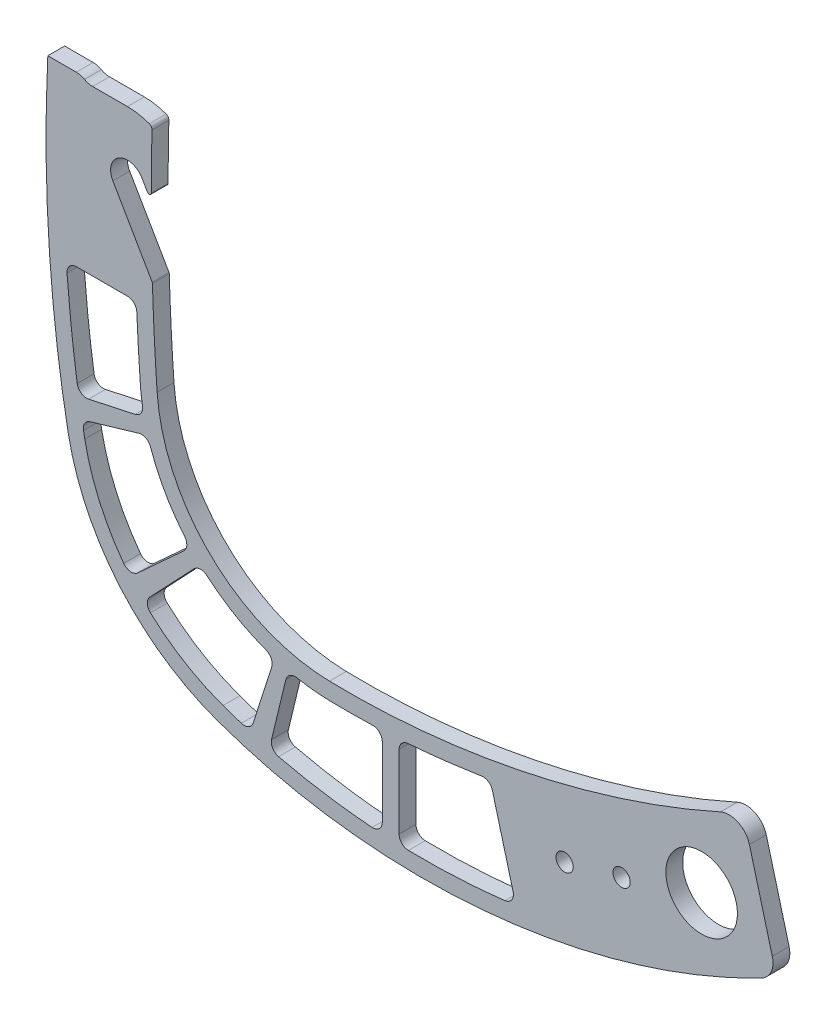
ISO-10303-21;
HEADER;
FILE_DESCRIPTION(('STEP AP214'),'2;1');
FILE_NAME('part.step','',(''),(''),'','','');
FILE_SCHEMA(('AUTOMOTIVE_DESIGN { 1 0 10303 214 1 1 1 1 }'));
ENDSEC;
DATA;
#1=APPLICATION_CONTEXT('core data for automotive mechanical design processes');
#2=APPLICATION_PROTOCOL_DEFINITION('international standard','automotive_design',2000,#1);
#3=PRODUCT_CONTEXT('',#1,'mechanical');
#4=PRODUCT('Part','Part','',(#3));
#5=PRODUCT_RELATED_PRODUCT_CATEGORY('part','',(#4));
#6=PRODUCT_DEFINITION_FORMATION('','',#4);
#7=PRODUCT_DEFINITION_CONTEXT('part definition',#1,'design');
#8=PRODUCT_DEFINITION('design','',#6,#7);
#9=PRODUCT_DEFINITION_SHAPE('','',#8);
#10=(LENGTH_UNIT() NAMED_UNIT(*) SI_UNIT(.MILLI.,.METRE.));
#11=(NAMED_UNIT(*) PLANE_ANGLE_UNIT() SI_UNIT($,.RADIAN.));
#12=(NAMED_UNIT(*) SI_UNIT($,.STERADIAN.) SOLID_ANGLE_UNIT());
#13=UNCERTAINTY_MEASURE_WITH_UNIT(LENGTH_MEASURE(1.E-05),#10,'distance_accuracy_value','');
#14=(GEOMETRIC_REPRESENTATION_CONTEXT(3) GLOBAL_UNCERTAINTY_ASSIGNED_CONTEXT((#13)) GLOBAL_UNIT_ASSIGNED_CONTEXT((#10,
#11,#12)) REPRESENTATION_CONTEXT('',''));
#15=CARTESIAN_POINT('',(0.,0.,0.));
#16=DIRECTION('',(0.,0.,1.));
#17=DIRECTION('',(1.,0.,0.));
#18=AXIS2_PLACEMENT_3D('',#15,#16,#17);
#19=CARTESIAN_POINT('',(-14.239497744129,-121.423692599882,4.));
#20=DIRECTION('',(0.,0.,-1.));
#21=DIRECTION('',(0.,-1.,0.));
#22=AXIS2_PLACEMENT_3D('',#19,#20,#21);
#23=ELLIPSE('',#22,120.,25.);
#24=DIRECTION('',(0.,0.,-1.));
#25=VECTOR('',#24,1.);
#26=SURFACE_OF_LINEAR_EXTRUSION('',#23,#25);
#27=CARTESIAN_POINT('',(-14.239497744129,-121.423692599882,0.));
#28=DIRECTION('',(0.,0.,-1.));
#29=DIRECTION('',(0.,-1.,0.));
#30=AXIS2_PLACEMENT_3D('',#27,#28,#29);
#31=ELLIPSE('',#30,120.,25.);
#32=CARTESIAN_POINT('',(-39.2387632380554,-120.503834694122,0.));
#33=VERTEX_POINT('',#32);
#34=CARTESIAN_POINT('',(-39.0691872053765,-107.44050806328,0.));
#35=VERTEX_POINT('',#34);
#36=EDGE_CURVE('E736',#33,#35,#31,.T.);
#37=ORIENTED_EDGE('',*,*,#36,.T.);
#38=DIRECTION('',(0.,0.,-1.));
#39=VECTOR('',#38,1.);
#40=CARTESIAN_POINT('',(-39.0691872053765,-107.44050806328,0.));
#41=LINE('',#40,#39);
#42=CARTESIAN_POINT('',(-39.0691872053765,-107.44050806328,4.));
#43=VERTEX_POINT('',#42);
#44=EDGE_CURVE('E748',#35,#43,#41,.F.);
#45=ORIENTED_EDGE('',*,*,#44,.T.);
#46=CARTESIAN_POINT('',(-39.2387632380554,-120.503834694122,4.));
#47=VERTEX_POINT('',#46);
#48=EDGE_CURVE('E704',#47,#43,#23,.T.);
#49=ORIENTED_EDGE('',*,*,#48,.F.);
#50=DIRECTION('',(0.,0.,-1.));
#51=VECTOR('',#50,1.);
#52=CARTESIAN_POINT('',(-39.2387632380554,-120.503834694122,4.));
#53=LINE('',#52,#51);
#54=EDGE_CURVE('E746',#47,#33,#53,.T.);
#55=ORIENTED_EDGE('',*,*,#54,.T.);
#56=EDGE_LOOP('',(#37,#45,#49,#55));
#57=FACE_BOUND('',#56,.T.);
#58=ADVANCED_FACE('F32',(#57),#26,.F.);
#59=CARTESIAN_POINT('',(-14.239497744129,-121.423692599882,4.));
#60=DIRECTION('',(0.,0.,1.));
#61=DIRECTION('',(0.,1.,0.));
#62=AXIS2_PLACEMENT_3D('',#59,#60,#61);
#63=ELLIPSE('',#62,130.446604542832,50.);
#64=DIRECTION('',(0.,0.,-1.));
#65=VECTOR('',#64,1.);
#66=SURFACE_OF_LINEAR_EXTRUSION('',#63,#65);
#67=DIRECTION('',(0.,0.,-1.));
#68=VECTOR('',#67,1.);
#69=CARTESIAN_POINT('',(-63.8196316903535,-104.554103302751,4.));
#70=LINE('',#69,#68);
#71=CARTESIAN_POINT('',(-63.8196316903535,-104.554103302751,0.));
#72=VERTEX_POINT('',#71);
#73=CARTESIAN_POINT('',(-63.8196316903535,-104.554103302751,4.));
#74=VERTEX_POINT('',#73);
#75=EDGE_CURVE('E1022',#72,#74,#70,.F.);
#76=ORIENTED_EDGE('',*,*,#75,.F.);
#77=CARTESIAN_POINT('',(-14.239497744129,-121.423692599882,0.));
#78=DIRECTION('',(0.,0.,1.));
#79=DIRECTION('',(0.,1.,0.));
#80=AXIS2_PLACEMENT_3D('',#77,#78,#79);
#81=ELLIPSE('',#80,130.446604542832,50.);
#82=CARTESIAN_POINT('',(-58.963636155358,-179.746685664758,0.));
#83=VERTEX_POINT('',#82);
#84=EDGE_CURVE('E693',#72,#83,#81,.T.);
#85=ORIENTED_EDGE('',*,*,#84,.T.);
#86=DIRECTION('',(0.,0.,-1.));
#87=VECTOR('',#86,1.);
#88=CARTESIAN_POINT('',(-58.963636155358,-179.746685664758,0.));
#89=LINE('',#88,#87);
#90=CARTESIAN_POINT('',(-58.963636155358,-179.746685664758,4.));
#91=VERTEX_POINT('',#90);
#92=EDGE_CURVE('E1218',#83,#91,#89,.F.);
#93=ORIENTED_EDGE('',*,*,#92,.T.);
#94=EDGE_CURVE('E1027',#74,#91,#63,.T.);
#95=ORIENTED_EDGE('',*,*,#94,.F.);
#96=EDGE_LOOP('',(#76,#85,#93,#95));
#97=FACE_BOUND('',#96,.T.);
#98=ADVANCED_FACE('F683',(#97),#66,.F.);
#99=CARTESIAN_POINT('',(-37.8564803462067,-160.783146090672,0.));
#100=VERTEX_POINT('',#99);
#101=CARTESIAN_POINT('',(-38.9713819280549,-138.951189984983,0.));
#102=VERTEX_POINT('',#101);
#103=EDGE_CURVE('E705',#100,#102,#31,.T.);
#104=ORIENTED_EDGE('',*,*,#103,.T.);
#105=DIRECTION('',(0.,0.,-1.));
#106=VECTOR('',#105,1.);
#107=CARTESIAN_POINT('',(-38.9713819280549,-138.951189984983,0.));
#108=LINE('',#107,#106);
#109=CARTESIAN_POINT('',(-38.9713819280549,-138.951189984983,4.));
#110=VERTEX_POINT('',#109);
#111=EDGE_CURVE('E1180',#102,#110,#108,.F.);
#112=ORIENTED_EDGE('',*,*,#111,.T.);
#113=CARTESIAN_POINT('',(-37.8564803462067,-160.783146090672,4.));
#114=VERTEX_POINT('',#113);
#115=EDGE_CURVE('E699',#114,#110,#23,.T.);
#116=ORIENTED_EDGE('',*,*,#115,.F.);
#117=DIRECTION('',(0.,0.,-1.));
#118=VECTOR('',#117,1.);
#119=CARTESIAN_POINT('',(-37.8564803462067,-160.783146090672,4.));
#120=LINE('',#119,#118);
#121=EDGE_CURVE('E703',#114,#100,#120,.T.);
#122=ORIENTED_EDGE('',*,*,#121,.T.);
#123=EDGE_LOOP('',(#104,#112,#116,#122));
#124=FACE_BOUND('',#123,.T.);
#125=ADVANCED_FACE('F674',(#124),#26,.F.);
#126=CARTESIAN_POINT('',(-14.239497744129,-121.423692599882,4.));
#127=DIRECTION('',(0.,0.,1.));
#128=DIRECTION('',(1.,0.,0.));
#129=AXIS2_PLACEMENT_3D('',#126,#127,#128);
#130=PLANE('',#129);
#131=CARTESIAN_POINT('',(-22.1978351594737,-217.391072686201,4.));
#132=CARTESIAN_POINT('',(-21.042336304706,-217.806427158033,4.));
#133=CARTESIAN_POINT('',(-18.7275542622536,-218.598261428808,4.));
#134=CARTESIAN_POINT('',(-13.9778004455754,-220.063977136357,4.));
#135=CARTESIAN_POINT('',(-7.87584435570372,-221.653056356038,4.));
#136=CARTESIAN_POINT('',(-0.306640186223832,-223.166587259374,4.));
#137=CARTESIAN_POINT('',(10.0637305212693,-224.647435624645,4.));
#138=CARTESIAN_POINT('',(23.4634861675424,-225.475801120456,4.));
#139=CARTESIAN_POINT('',(39.9516308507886,-224.807549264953,4.));
#140=CARTESIAN_POINT('',(56.5499470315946,-222.485213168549,4.));
#141=CARTESIAN_POINT('',(72.9607346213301,-218.54728858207,4.));
#142=CARTESIAN_POINT('',(86.2273999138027,-213.981093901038,4.));
#143=CARTESIAN_POINT('',(96.4658071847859,-209.600741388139,4.));
#144=CARTESIAN_POINT('',(101.414118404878,-207.1903843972,4.));
#145=CARTESIAN_POINT('',(103.863418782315,-205.920787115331,4.));
#146=B_SPLINE_CURVE_WITH_KNOTS('',3,(#131,#132,#133,#134,#135,#136,#137,#138,#139,#140,#141,
#142,#143,#144,#145),.UNSPECIFIED.,.F.,.F.,(4,1,1,1,1,1,1,1,1,1,1,1,4),(0.807288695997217,
0.840345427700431,0.873402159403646,0.939515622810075,1.0056290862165,1.07174254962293,
1.20396947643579,1.33619640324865,1.46842333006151,1.60065025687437,1.73287718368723,
1.79899064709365,1.86510411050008),.UNSPECIFIED.);
#147=CARTESIAN_POINT('',(21.8199347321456,-225.172404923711,4.));
#148=VERTEX_POINT('',#147);
#149=CARTESIAN_POINT('',(44.7712839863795,-224.028796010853,4.));
#150=VERTEX_POINT('',#149);
#151=EDGE_CURVE('E1729',#148,#150,#146,.T.);
#152=ORIENTED_EDGE('',*,*,#151,.F.);
#153=CARTESIAN_POINT('',(21.8667154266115,-222.922891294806,4.));
#154=DIRECTION('',(0.,0.,1.));
#155=DIRECTION('',(1.,0.,0.));
#156=AXIS2_PLACEMENT_3D('',#153,#154,#155);
#157=CIRCLE('',#156,2.25);
#158=CARTESIAN_POINT('',(19.6167154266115,-222.922891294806,4.));
#159=VERTEX_POINT('',#158);
#160=EDGE_CURVE('E876',#148,#159,#157,.F.);
#161=ORIENTED_EDGE('',*,*,#160,.T.);
#162=DIRECTION('',(0.,-1.,0.));
#163=VECTOR('',#162,1.);
#164=CARTESIAN_POINT('',(19.6167154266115,-225.111179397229,4.));
#165=LINE('',#164,#163);
#166=CARTESIAN_POINT('',(19.6167154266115,-205.478867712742,4.));
#167=VERTEX_POINT('',#166);
#168=EDGE_CURVE('E1713',#167,#159,#165,.T.);
#169=ORIENTED_EDGE('',*,*,#168,.F.);
#170=CARTESIAN_POINT('',(21.8667154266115,-205.478867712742,4.));
#171=DIRECTION('',(0.,0.,1.));
#172=DIRECTION('',(1.,0.,0.));
#173=AXIS2_PLACEMENT_3D('',#170,#171,#172);
#174=CIRCLE('',#173,2.25);
#175=CARTESIAN_POINT('',(21.6987738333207,-203.235144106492,4.));
#176=VERTEX_POINT('',#175);
#177=EDGE_CURVE('E891',#167,#176,#174,.F.);
#178=ORIENTED_EDGE('',*,*,#177,.T.);
#179=CARTESIAN_POINT('',(97.5612595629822,-183.853455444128,4.));
#180=CARTESIAN_POINT('',(95.7187301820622,-184.684505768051,4.));
#181=CARTESIAN_POINT('',(92.0224207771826,-186.288941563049,4.));
#182=CARTESIAN_POINT('',(84.4422956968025,-189.332071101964,4.));
#183=CARTESIAN_POINT('',(74.7251928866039,-192.777716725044,4.));
#184=CARTESIAN_POINT('',(62.7711061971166,-196.309022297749,4.));
#185=CARTESIAN_POINT('',(50.6492985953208,-199.198944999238,4.));
#186=CARTESIAN_POINT('',(38.4802315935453,-201.419040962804,4.));
#187=CARTESIAN_POINT('',(26.3828964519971,-202.946061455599,4.));
#188=CARTESIAN_POINT('',(16.4710422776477,-203.627383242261,4.));
#189=CARTESIAN_POINT('',(8.68119663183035,-203.812169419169,4.));
#190=CARTESIAN_POINT('',(4.87764759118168,-203.784877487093,4.));
#191=CARTESIAN_POINT('',(2.96515028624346,-203.740414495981,4.));
#192=B_SPLINE_CURVE_WITH_KNOTS('',3,(#179,#180,#181,#182,#183,#184,#185,#186,#187,#188,#189,
#190,#191),.UNSPECIFIED.,.F.,.F.,(4,1,1,1,1,1,1,1,1,1,4),(-2.08325727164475,-2.03223346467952,
-1.98120965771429,-1.87916204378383,-1.77711442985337,-1.67506681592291,-1.57301920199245,
-1.47097158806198,-1.36892397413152,-1.31790016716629,-1.26687636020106),.UNSPECIFIED.);
#193=CARTESIAN_POINT('',(39.2284712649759,-201.188579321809,4.));
#194=VERTEX_POINT('',#193);
#195=EDGE_CURVE('E1740',#194,#176,#192,.T.);
#196=ORIENTED_EDGE('',*,*,#195,.F.);
#197=CARTESIAN_POINT('',(39.5792343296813,-203.411070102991,4.));
#198=DIRECTION('',(0.,0.,1.));
#199=DIRECTION('',(1.,0.,0.));
#200=AXIS2_PLACEMENT_3D('',#197,#198,#199);
#201=CIRCLE('',#200,2.25);
#202=CARTESIAN_POINT('',(41.7525674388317,-202.82872725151,4.));
#203=VERTEX_POINT('',#202);
#204=EDGE_CURVE('E884',#194,#203,#201,.F.);
#205=ORIENTED_EDGE('',*,*,#204,.T.);
#206=DIRECTION('',(-0.258819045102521,0.965925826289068,0.));
#207=VECTOR('',#206,1.);
#208=CARTESIAN_POINT('',(41.2261413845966,-200.864078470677,4.));
#209=LINE('',#208,#207);
#210=CARTESIAN_POINT('',(46.678419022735,-221.212255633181,4.));
#211=VERTEX_POINT('',#210);
#212=EDGE_CURVE('E1734',#211,#203,#209,.T.);
#213=ORIENTED_EDGE('',*,*,#212,.F.);
#214=CARTESIAN_POINT('',(44.5050859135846,-221.794598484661,4.));
#215=DIRECTION('',(0.,0.,1.));
#216=DIRECTION('',(1.,0.,0.));
#217=AXIS2_PLACEMENT_3D('',#214,#215,#216);
#218=CIRCLE('',#217,2.25);
#219=EDGE_CURVE('E880',#211,#150,#218,.F.);
#220=ORIENTED_EDGE('',*,*,#219,.T.);
#221=EDGE_LOOP('',(#152,#161,#169,#178,#196,#205,#213,#220));
#222=FACE_BOUND('',#221,.T.);
#223=CARTESIAN_POINT('',(-22.1977858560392,-217.390889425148,4.));
#224=CARTESIAN_POINT('',(-21.0422898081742,-217.806251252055,4.));
#225=CARTESIAN_POINT('',(-18.727513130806,-218.598100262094,4.));
#226=CARTESIAN_POINT('',(-13.9777693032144,-220.06384623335,4.));
#227=CARTESIAN_POINT('',(-7.87582416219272,-221.65296436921,4.));
#228=CARTESIAN_POINT('',(-0.306630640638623,-223.166543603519,4.));
#229=CARTESIAN_POINT('',(10.0637292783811,-224.647458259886,4.));
#230=CARTESIAN_POINT('',(23.4634779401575,-225.475909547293,4.));
#231=CARTESIAN_POINT('',(39.9516248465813,-224.807763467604,4.));
#232=CARTESIAN_POINT('',(56.5499538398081,-222.485534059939,4.));
#233=CARTESIAN_POINT('',(72.9607646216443,-218.547715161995,4.));
#234=CARTESIAN_POINT('',(86.2274575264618,-213.981606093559,4.));
#235=CARTESIAN_POINT('',(96.4658915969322,-209.601319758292,4.));
#236=CARTESIAN_POINT('',(101.414217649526,-207.190994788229,4.));
#237=CARTESIAN_POINT('',(103.863525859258,-205.92141336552,4.));
#238=B_SPLINE_CURVE_WITH_KNOTS('',3,(#223,#224,#225,#226,#227,#228,#229,#230,#231,#232,#233,
#234,#235,#236,#237),.UNSPECIFIED.,.F.,.F.,(4,1,1,1,1,1,1,1,1,1,1,1,4),(0.807288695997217,
0.840345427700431,0.873402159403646,0.939515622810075,1.0056290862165,1.07174254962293,
1.20396947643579,1.33619640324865,1.46842333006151,1.60065025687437,1.73287718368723,
1.79899064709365,1.86510411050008),.UNSPECIFIED.);
#239=CARTESIAN_POINT('',(-9.01350030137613,-221.310964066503,4.));
#240=VERTEX_POINT('',#239);
#241=CARTESIAN_POINT('',(13.1949161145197,-224.754379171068,4.));
#242=VERTEX_POINT('',#241);
#243=EDGE_CURVE('E483',#240,#242,#238,.T.);
#244=ORIENTED_EDGE('',*,*,#243,.F.);
#245=CARTESIAN_POINT('',(-8.48977485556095,-219.122765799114,4.));
#246=DIRECTION('',(0.,0.,1.));
#247=DIRECTION('',(1.,0.,0.));
#248=AXIS2_PLACEMENT_3D('',#245,#246,#247);
#249=CIRCLE('',#248,2.25);
#250=CARTESIAN_POINT('',(-10.6767540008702,-218.593972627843,4.));
#251=VERTEX_POINT('',#250);
#252=EDGE_CURVE('E895',#240,#251,#249,.F.);
#253=ORIENTED_EDGE('',*,*,#252,.T.);
#254=DIRECTION('',(-0.235019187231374,-0.971990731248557,0.));
#255=VECTOR('',#254,1.);
#256=CARTESIAN_POINT('',(-11.2022133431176,-220.767163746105,4.));
#257=LINE('',#256,#255);
#258=CARTESIAN_POINT('',(-7.29326694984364,-204.600570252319,4.));
#259=VERTEX_POINT('',#258);
#260=EDGE_CURVE('E506',#259,#251,#257,.T.);
#261=ORIENTED_EDGE('',*,*,#260,.F.);
#262=CARTESIAN_POINT('',(-5.10628780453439,-205.129363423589,4.));
#263=DIRECTION('',(0.,0.,1.));
#264=DIRECTION('',(1.,0.,0.));
#265=AXIS2_PLACEMENT_3D('',#262,#263,#264);
#266=CIRCLE('',#265,2.25);
#267=CARTESIAN_POINT('',(-4.68005337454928,-202.920104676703,4.));
#268=VERTEX_POINT('',#267);
#269=EDGE_CURVE('E899',#259,#268,#266,.F.);
#270=ORIENTED_EDGE('',*,*,#269,.T.);
#271=CARTESIAN_POINT('',(4.03407274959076,-157.753036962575,4.));
#272=DIRECTION('',(0.,0.,-1.));
#273=DIRECTION('',(1.,0.,0.));
#274=AXIS2_PLACEMENT_3D('',#271,#272,#273);
#275=CIRCLE('',#274,46.0000000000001);
#276=CARTESIAN_POINT('',(2.84753818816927,-203.737731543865,4.));
#277=VERTEX_POINT('',#276);
#278=EDGE_CURVE('E503',#277,#268,#275,.T.);
#279=ORIENTED_EDGE('',*,*,#278,.F.);
#280=DIRECTION('',(-0.999699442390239,0.0245158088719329,0.));
#281=VECTOR('',#280,1.);
#282=CARTESIAN_POINT('',(2.84753818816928,-203.737731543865,4.));
#283=LINE('',#282,#281);
#284=CARTESIAN_POINT('',(2.96515473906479,-203.740615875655,4.));
#285=VERTEX_POINT('',#284);
#286=EDGE_CURVE('E498',#285,#277,#283,.T.);
#287=ORIENTED_EDGE('',*,*,#286,.F.);
#288=CARTESIAN_POINT('',(97.5611100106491,-183.852840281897,4.));
#289=CARTESIAN_POINT('',(95.718587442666,-184.683906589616,4.));
#290=CARTESIAN_POINT('',(92.0222911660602,-186.288374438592,4.));
#291=CARTESIAN_POINT('',(84.442190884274,-189.331569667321,4.));
#292=CARTESIAN_POINT('',(74.7251159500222,-192.777299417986,4.));
#293=CARTESIAN_POINT('',(62.7710574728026,-196.308708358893,4.));
#294=CARTESIAN_POINT('',(50.649272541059,-199.198735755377,4.));
#295=CARTESIAN_POINT('',(38.4802224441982,-201.418936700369,4.));
#296=CARTESIAN_POINT('',(26.3828982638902,-202.946061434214,4.));
#297=CARTESIAN_POINT('',(16.4710481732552,-203.627468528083,4.));
#298=CARTESIAN_POINT('',(8.68120272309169,-203.812321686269,4.));
#299=CARTESIAN_POINT('',(4.87765276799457,-203.785062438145,4.));
#300=CARTESIAN_POINT('',(2.96515473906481,-203.740615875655,4.));
#301=B_SPLINE_CURVE_WITH_KNOTS('',3,(#288,#289,#290,#291,#292,#293,#294,#295,#296,#297,#298,
#299,#300),.UNSPECIFIED.,.F.,.F.,(4,1,1,1,1,1,1,1,1,1,4),(-2.08325727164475,-2.03223346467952,
-1.98120965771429,-1.87916204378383,-1.77711442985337,-1.67506681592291,-1.57301920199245,
-1.47097158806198,-1.36892397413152,-1.31790016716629,-1.26687636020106),.UNSPECIFIED.);
#302=CARTESIAN_POINT('',(13.2936206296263,-203.688010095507,4.));
#303=VERTEX_POINT('',#302);
#304=EDGE_CURVE('E464',#303,#285,#301,.T.);
#305=ORIENTED_EDGE('',*,*,#304,.F.);
#306=CARTESIAN_POINT('',(13.3667579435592,-205.936821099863,4.));
#307=DIRECTION('',(0.,0.,1.));
#308=DIRECTION('',(1.,0.,0.));
#309=AXIS2_PLACEMENT_3D('',#306,#307,#308);
#310=CIRCLE('',#309,2.25);
#311=CARTESIAN_POINT('',(15.6167579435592,-205.936821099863,4.));
#312=VERTEX_POINT('',#311);
#313=EDGE_CURVE('E888',#303,#312,#310,.F.);
#314=ORIENTED_EDGE('',*,*,#313,.T.);
#315=DIRECTION('',(0.,1.,0.));
#316=VECTOR('',#315,1.);
#317=CARTESIAN_POINT('',(15.6167579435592,-203.598576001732,4.));
#318=LINE('',#317,#316);
#319=CARTESIAN_POINT('',(15.6167579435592,-222.510950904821,4.));
#320=VERTEX_POINT('',#319);
#321=EDGE_CURVE('E488',#320,#312,#318,.T.);
#322=ORIENTED_EDGE('',*,*,#321,.F.);
#323=CARTESIAN_POINT('',(13.3667579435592,-222.510950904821,4.));
#324=DIRECTION('',(0.,0.,1.));
#325=DIRECTION('',(1.,0.,0.));
#326=AXIS2_PLACEMENT_3D('',#323,#324,#325);
#327=CIRCLE('',#326,2.25);
#328=EDGE_CURVE('E872',#320,#242,#327,.F.);
#329=ORIENTED_EDGE('',*,*,#328,.T.);
#330=EDGE_LOOP('',(#244,#253,#261,#270,#279,#287,#305,#314,#322,#329));
#331=FACE_BOUND('',#330,.T.);
#332=CARTESIAN_POINT('',(4.03407274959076,-157.753036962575,4.));
#333=DIRECTION('',(0.,0.,-1.));
#334=DIRECTION('',(1.,0.,0.));
#335=AXIS2_PLACEMENT_3D('',#332,#333,#334);
#336=CIRCLE('',#335,46.0000000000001);
#337=CARTESIAN_POINT('',(-12.0038441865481,-200.866668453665,4.));
#338=VERTEX_POINT('',#337);
#339=CARTESIAN_POINT('',(-26.0202522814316,-192.577418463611,4.));
#340=VERTEX_POINT('',#339);
#341=EDGE_CURVE('E510',#338,#340,#336,.T.);
#342=ORIENTED_EDGE('',*,*,#341,.F.);
#343=CARTESIAN_POINT('',(-12.7883075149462,-202.975487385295,4.));
#344=DIRECTION('',(0.,0.,1.));
#345=DIRECTION('',(1.,0.,0.));
#346=AXIS2_PLACEMENT_3D('',#343,#344,#345);
#347=CIRCLE('',#346,2.25);
#348=CARTESIAN_POINT('',(-10.6452015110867,-203.660758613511,4.));
#349=VERTEX_POINT('',#348);
#350=EDGE_CURVE('E931',#338,#349,#347,.F.);
#351=ORIENTED_EDGE('',*,*,#350,.T.);
#352=DIRECTION('',(0.304564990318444,0.952491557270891,0.));
#353=VECTOR('',#352,1.);
#354=CARTESIAN_POINT('',(-9.97591680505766,-201.567648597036,4.));
#355=LINE('',#354,#353);
#356=CARTESIAN_POINT('',(-15.0375935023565,-217.397453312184,4.));
#357=VERTEX_POINT('',#356);
#358=EDGE_CURVE('E516',#357,#349,#355,.T.);
#359=ORIENTED_EDGE('',*,*,#358,.F.);
#360=CARTESIAN_POINT('',(-17.1806995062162,-216.712182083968,4.));
#361=DIRECTION('',(0.,0.,1.));
#362=DIRECTION('',(1.,0.,0.));
#363=AXIS2_PLACEMENT_3D('',#360,#361,#362);
#364=CIRCLE('',#363,2.25);
#365=CARTESIAN_POINT('',(-17.860756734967,-218.856948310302,4.));
#366=VERTEX_POINT('',#365);
#367=EDGE_CURVE('E927',#357,#366,#364,.F.);
#368=ORIENTED_EDGE('',*,*,#367,.T.);
#369=CARTESIAN_POINT('',(-22.1978158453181,-217.391004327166,4.));
#370=CARTESIAN_POINT('',(-21.0423184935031,-217.80636186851,4.));
#371=CARTESIAN_POINT('',(-18.7275393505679,-218.598202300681,4.));
#372=CARTESIAN_POINT('',(-13.9777910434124,-220.063930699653,4.));
#373=CARTESIAN_POINT('',(-7.87584121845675,-221.653026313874,4.));
#374=CARTESIAN_POINT('',(-0.30664355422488,-223.166577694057,4.));
#375=CARTESIAN_POINT('',(10.063719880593,-224.647454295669,4.));
#376=CARTESIAN_POINT('',(23.4634691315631,-225.475856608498,4.));
#377=CARTESIAN_POINT('',(39.9516106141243,-224.807650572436,4.));
#378=CARTESIAN_POINT('',(56.5499281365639,-222.485361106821,4.));
#379=CARTESIAN_POINT('',(72.9607215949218,-218.547483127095,4.));
#380=CARTESIAN_POINT('',(86.2273954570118,-213.981326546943,4.));
#381=CARTESIAN_POINT('',(96.4658117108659,-209.601003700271,4.));
#382=CARTESIAN_POINT('',(101.414128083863,-207.190661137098,4.));
#383=CARTESIAN_POINT('',(103.86343122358,-205.921071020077,4.));
#384=B_SPLINE_CURVE_WITH_KNOTS('',3,(#369,#370,#371,#372,#373,#374,#375,#376,#377,#378,#379,
#380,#381,#382,#383),.UNSPECIFIED.,.F.,.F.,(4,1,1,1,1,1,1,1,1,1,1,1,4),(0.807288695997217,
0.840345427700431,0.873402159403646,0.939515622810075,1.0056290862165,1.07174254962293,
1.20396947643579,1.33619640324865,1.46842333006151,1.60065025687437,1.73287718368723,
1.79899064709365,1.86510411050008),.UNSPECIFIED.);
#385=CARTESIAN_POINT('',(-22.1978158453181,-217.391004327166,4.));
#386=VERTEX_POINT('',#385);
#387=EDGE_CURVE('E1798',#386,#366,#384,.T.);
#388=ORIENTED_EDGE('',*,*,#387,.F.);
#389=CARTESIAN_POINT('',(-4.94610252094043,-169.397479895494,4.));
#390=DIRECTION('',(0.,0.,1.));
#391=DIRECTION('',(1.,0.,0.));
#392=AXIS2_PLACEMENT_3D('',#389,#390,#391);
#393=CIRCLE('',#392,51.);
#394=CARTESIAN_POINT('',(-39.4526458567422,-206.951420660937,4.));
#395=VERTEX_POINT('',#394);
#396=EDGE_CURVE('E1803',#395,#386,#393,.T.);
#397=ORIENTED_EDGE('',*,*,#396,.F.);
#398=CARTESIAN_POINT('',(-37.9302983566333,-205.29462915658,4.));
#399=DIRECTION('',(0.,0.,1.));
#400=DIRECTION('',(1.,0.,0.));
#401=AXIS2_PLACEMENT_3D('',#398,#399,#400);
#402=CIRCLE('',#401,2.25);
#403=CARTESIAN_POINT('',(-39.5632603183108,-203.746748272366,4.));
#404=VERTEX_POINT('',#403);
#405=EDGE_CURVE('E919',#395,#404,#402,.F.);
#406=ORIENTED_EDGE('',*,*,#405,.T.);
#407=DIRECTION('',(-0.687947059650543,-0.725760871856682,0.));
#408=VECTOR('',#407,1.);
#409=CARTESIAN_POINT('',(-41.1001383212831,-205.368102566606,4.));
#410=LINE('',#409,#408);
#411=CARTESIAN_POINT('',(-29.1232627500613,-192.732904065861,4.));
#412=VERTEX_POINT('',#411);
#413=EDGE_CURVE('E1808',#412,#404,#410,.T.);
#414=ORIENTED_EDGE('',*,*,#413,.F.);
#415=CARTESIAN_POINT('',(-27.4903007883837,-194.280784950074,4.));
#416=DIRECTION('',(0.,0.,1.));
#417=DIRECTION('',(1.,0.,0.));
#418=AXIS2_PLACEMENT_3D('',#415,#416,#417);
#419=CIRCLE('',#418,2.25);
#420=EDGE_CURVE('E923',#412,#340,#419,.F.);
#421=ORIENTED_EDGE('',*,*,#420,.T.);
#422=EDGE_LOOP('',(#342,#351,#359,#368,#388,#397,#406,#414,#421));
#423=FACE_BOUND('',#422,.T.);
#424=CARTESIAN_POINT('',(4.03407274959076,-157.753036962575,4.));
#425=DIRECTION('',(0.,0.,-1.));
#426=DIRECTION('',(1.,0.,0.));
#427=AXIS2_PLACEMENT_3D('',#424,#425,#426);
#428=CIRCLE('',#427,46.);
#429=CARTESIAN_POINT('',(-31.3330078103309,-187.166802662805,4.));
#430=VERTEX_POINT('',#429);
#431=CARTESIAN_POINT('',(-39.4312517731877,-172.811774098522,4.));
#432=VERTEX_POINT('',#431);
#433=EDGE_CURVE('E587',#430,#432,#428,.T.);
#434=ORIENTED_EDGE('',*,*,#433,.F.);
#435=CARTESIAN_POINT('',(-33.0629193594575,-188.60551946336,4.));
#436=DIRECTION('',(0.,0.,1.));
#437=DIRECTION('',(1.,0.,0.));
#438=AXIS2_PLACEMENT_3D('',#435,#436,#437);
#439=CIRCLE('',#438,2.25);
#440=CARTESIAN_POINT('',(-31.5450982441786,-190.266458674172,4.));
#441=VERTEX_POINT('',#440);
#442=EDGE_CURVE('E939',#430,#441,#439,.F.);
#443=ORIENTED_EDGE('',*,*,#442,.T.);
#444=DIRECTION('',(0.738195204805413,0.674587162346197,0.));
#445=VECTOR('',#444,1.);
#446=CARTESIAN_POINT('',(-29.9229066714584,-188.7840464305,4.));
#447=LINE('',#446,#445);
#448=CARTESIAN_POINT('',(-42.4712067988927,-200.251097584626,4.));
#449=VERTEX_POINT('',#448);
#450=EDGE_CURVE('E604',#449,#441,#447,.T.);
#451=ORIENTED_EDGE('',*,*,#450,.F.);
#452=CARTESIAN_POINT('',(-43.9890279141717,-198.590158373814,4.));
#453=DIRECTION('',(0.,0.,1.));
#454=DIRECTION('',(1.,0.,0.));
#455=AXIS2_PLACEMENT_3D('',#452,#453,#454);
#456=CIRCLE('',#455,2.25);
#457=CARTESIAN_POINT('',(-45.791009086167,-199.937512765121,4.));
#458=VERTEX_POINT('',#457);
#459=EDGE_CURVE('E935',#449,#458,#456,.F.);
#460=ORIENTED_EDGE('',*,*,#459,.T.);
#461=CARTESIAN_POINT('',(-4.94610252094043,-169.397479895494,4.));
#462=DIRECTION('',(0.,0.,1.));
#463=DIRECTION('',(1.,0.,0.));
#464=AXIS2_PLACEMENT_3D('',#461,#462,#463);
#465=CIRCLE('',#464,51.);
#466=CARTESIAN_POINT('',(-55.0350882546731,-178.994016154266,4.));
#467=VERTEX_POINT('',#466);
#468=EDGE_CURVE('E598',#467,#458,#465,.T.);
#469=ORIENTED_EDGE('',*,*,#468,.F.);
#470=CARTESIAN_POINT('',(-59.8241254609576,-104.753780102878,4.));
#471=CARTESIAN_POINT('',(-59.9825898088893,-107.923364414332,4.));
#472=CARTESIAN_POINT('',(-60.2078604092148,-114.256726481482,4.));
#473=CARTESIAN_POINT('',(-60.2986664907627,-127.016681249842,4.));
#474=CARTESIAN_POINT('',(-59.844700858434,-139.738430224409,4.));
#475=CARTESIAN_POINT('',(-58.8550201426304,-152.220411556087,4.));
#476=CARTESIAN_POINT('',(-57.8493192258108,-161.408299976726,4.));
#477=CARTESIAN_POINT('',(-56.797914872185,-168.870948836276,4.));
#478=CARTESIAN_POINT('',(-55.8300545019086,-174.712919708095,4.));
#479=CARTESIAN_POINT('',(-55.3091723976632,-177.563386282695,4.));
#480=CARTESIAN_POINT('',(-55.0350882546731,-178.994016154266,4.));
#481=B_SPLINE_CURVE_WITH_KNOTS('',3,(#470,#471,#472,#473,#474,#475,#476,#477,#478,#479,#480),
.UNSPECIFIED.,.F.,.F.,(4,1,1,1,1,1,1,1,4),(1.44111132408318,1.51526236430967,1.58941340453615,
1.73771548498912,1.8118665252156,1.88601756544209,1.96016860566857,1.99724412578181,
2.03431964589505),.UNSPECIFIED.);
#482=CARTESIAN_POINT('',(-55.3406398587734,-177.370856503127,4.));
#483=VERTEX_POINT('',#482);
#484=EDGE_CURVE('E594',#483,#467,#481,.T.);
#485=ORIENTED_EDGE('',*,*,#484,.F.);
#486=CARTESIAN_POINT('',(-53.1281454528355,-176.961749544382,4.));
#487=DIRECTION('',(0.,0.,1.));
#488=DIRECTION('',(1.,0.,0.));
#489=AXIS2_PLACEMENT_3D('',#486,#487,#488);
#490=CIRCLE('',#489,2.25);
#491=CARTESIAN_POINT('',(-53.7647719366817,-174.803693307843,4.));
#492=VERTEX_POINT('',#491);
#493=EDGE_CURVE('E915',#483,#492,#490,.F.);
#494=ORIENTED_EDGE('',*,*,#493,.T.);
#495=DIRECTION('',(-0.959136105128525,-0.282945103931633,0.));
#496=VECTOR('',#495,1.);
#497=CARTESIAN_POINT('',(-55.7015556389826,-175.375044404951,4.));
#498=LINE('',#497,#496);
#499=CARTESIAN_POINT('',(-42.1938995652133,-171.390286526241,4.));
#500=VERTEX_POINT('',#499);
#501=EDGE_CURVE('E590',#500,#492,#498,.T.);
#502=ORIENTED_EDGE('',*,*,#501,.F.);
#503=CARTESIAN_POINT('',(-41.5572730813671,-173.548342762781,4.));
#504=DIRECTION('',(0.,0.,1.));
#505=DIRECTION('',(1.,0.,0.));
#506=AXIS2_PLACEMENT_3D('',#503,#504,#505);
#507=CIRCLE('',#506,2.25);
#508=EDGE_CURVE('E911',#500,#432,#507,.F.);
#509=ORIENTED_EDGE('',*,*,#508,.T.);
#510=EDGE_LOOP('',(#434,#443,#451,#460,#469,#485,#494,#502,#509));
#511=FACE_BOUND('',#510,.T.);
#512=CARTESIAN_POINT('',(-41.8460568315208,-161.071727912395,4.));
#513=CARTESIAN_POINT('',(-41.9762245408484,-159.272189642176,4.));
#514=CARTESIAN_POINT('',(-42.2158138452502,-155.689592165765,4.));
#515=CARTESIAN_POINT('',(-42.5245821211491,-150.204631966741,4.));
#516=CARTESIAN_POINT('',(-42.7786092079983,-144.672399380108,4.));
#517=CARTESIAN_POINT('',(-42.9122038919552,-140.936584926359,4.));
#518=CARTESIAN_POINT('',(-42.9694909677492,-139.074170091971,4.));
#519=B_SPLINE_CURVE_WITH_KNOTS('',3,(#512,#513,#514,#515,#516,#517,#518),.UNSPECIFIED.,.F.,.F.,
(4,1,1,1,4),(-1.42420944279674,-1.37731095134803,-1.33041245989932,-1.28351396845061,
-1.2366154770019),.UNSPECIFIED.);
#520=CARTESIAN_POINT('',(-41.8460568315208,-161.071727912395,4.));
#521=VERTEX_POINT('',#520);
#522=CARTESIAN_POINT('',(-42.6826792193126,-146.698952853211,4.));
#523=VERTEX_POINT('',#522);
#524=EDGE_CURVE('E610',#521,#523,#519,.T.);
#525=ORIENTED_EDGE('',*,*,#524,.F.);
#526=CARTESIAN_POINT('',(4.03407274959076,-157.753036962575,4.));
#527=DIRECTION('',(0.,0.,-1.));
#528=DIRECTION('',(1.,0.,0.));
#529=AXIS2_PLACEMENT_3D('',#526,#527,#528);
#530=CIRCLE('',#529,46.);
#531=CARTESIAN_POINT('',(-41.3311167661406,-165.368782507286,4.));
#532=VERTEX_POINT('',#531);
#533=EDGE_CURVE('E618',#532,#521,#530,.T.);
#534=ORIENTED_EDGE('',*,*,#533,.F.);
#535=CARTESIAN_POINT('',(-43.5500662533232,-165.741291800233,4.));
#536=DIRECTION('',(0.,0.,1.));
#537=DIRECTION('',(1.,0.,0.));
#538=AXIS2_PLACEMENT_3D('',#535,#536,#537);
#539=CIRCLE('',#538,2.25);
#540=CARTESIAN_POINT('',(-43.0744878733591,-167.940456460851,4.));
#541=VERTEX_POINT('',#540);
#542=EDGE_CURVE('E943',#532,#541,#539,.F.);
#543=ORIENTED_EDGE('',*,*,#542,.T.);
#544=DIRECTION('',(0.977406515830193,0.211368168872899,0.));
#545=VECTOR('',#544,1.);
#546=CARTESIAN_POINT('',(-40.9266269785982,-167.475972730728,4.));
#547=LINE('',#546,#545);
#548=CARTESIAN_POINT('',(-54.1300986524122,-170.331277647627,4.));
#549=VERTEX_POINT('',#548);
#550=EDGE_CURVE('E953',#549,#541,#547,.T.);
#551=ORIENTED_EDGE('',*,*,#550,.F.);
#552=CARTESIAN_POINT('',(-54.6056770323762,-168.132112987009,4.));
#553=DIRECTION('',(0.,0.,1.));
#554=DIRECTION('',(1.,0.,0.));
#555=AXIS2_PLACEMENT_3D('',#552,#553,#554);
#556=CIRCLE('',#555,2.25);
#557=CARTESIAN_POINT('',(-56.8306619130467,-168.466690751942,4.));
#558=VERTEX_POINT('',#557);
#559=EDGE_CURVE('E40',#549,#558,#556,.F.);
#560=ORIENTED_EDGE('',*,*,#559,.T.);
#561=CARTESIAN_POINT('',(-59.824587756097,-104.753807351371,4.));
#562=CARTESIAN_POINT('',(-59.9830331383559,-107.923392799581,4.));
#563=CARTESIAN_POINT('',(-60.2082658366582,-114.256756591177,4.));
#564=CARTESIAN_POINT('',(-60.2989955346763,-127.016712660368,4.));
#565=CARTESIAN_POINT('',(-59.8449537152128,-139.73845967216,4.));
#566=CARTESIAN_POINT('',(-58.8551982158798,-152.220435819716,4.));
#567=CARTESIAN_POINT('',(-57.8494422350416,-161.408318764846,4.));
#568=CARTESIAN_POINT('',(-56.7979931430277,-168.870961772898,4.));
#569=CARTESIAN_POINT('',(-55.8300977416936,-174.712927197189,4.));
#570=CARTESIAN_POINT('',(-55.3091985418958,-177.563390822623,4.));
#571=CARTESIAN_POINT('',(-55.0351058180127,-178.994019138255,4.));
#572=B_SPLINE_CURVE_WITH_KNOTS('',3,(#561,#562,#563,#564,#565,#566,#567,#568,#569,#570,#571),
.UNSPECIFIED.,.F.,.F.,(4,1,1,1,1,1,1,1,4),(1.44111132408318,1.51526236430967,1.58941340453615,
1.73771548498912,1.8118665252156,1.88601756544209,1.96016860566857,1.99724412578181,
2.03431964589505),.UNSPECIFIED.);
#573=CARTESIAN_POINT('',(-59.2592411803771,-146.972989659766,4.));
#574=VERTEX_POINT('',#573);
#575=EDGE_CURVE('E952',#574,#558,#572,.T.);
#576=ORIENTED_EDGE('',*,*,#575,.F.);
#577=CARTESIAN_POINT('',(-57.0159711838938,-146.799093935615,4.));
#578=DIRECTION('',(0.,0.,1.));
#579=DIRECTION('',(1.,0.,0.));
#580=AXIS2_PLACEMENT_3D('',#577,#578,#579);
#581=CIRCLE('',#580,2.25);
#582=CARTESIAN_POINT('',(-57.0159711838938,-144.549093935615,4.));
#583=VERTEX_POINT('',#582);
#584=EDGE_CURVE('E903',#574,#583,#581,.F.);
#585=ORIENTED_EDGE('',*,*,#584,.T.);
#586=DIRECTION('',(-1.,0.,0.));
#587=VECTOR('',#586,1.);
#588=CARTESIAN_POINT('',(-59.4378910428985,-144.549093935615,4.));
#589=LINE('',#588,#587);
#590=CARTESIAN_POINT('',(-44.930449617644,-144.549093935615,4.));
#591=VERTEX_POINT('',#590);
#592=EDGE_CURVE('E961',#591,#583,#589,.T.);
#593=ORIENTED_EDGE('',*,*,#592,.F.);
#594=CARTESIAN_POINT('',(-44.930449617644,-146.799093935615,4.));
#595=DIRECTION('',(0.,0.,1.));
#596=DIRECTION('',(1.,0.,0.));
#597=AXIS2_PLACEMENT_3D('',#594,#595,#596);
#598=CIRCLE('',#597,2.25);
#599=EDGE_CURVE('E907',#591,#523,#598,.F.);
#600=ORIENTED_EDGE('',*,*,#599,.T.);
#601=EDGE_LOOP('',(#525,#534,#543,#551,#560,#576,#585,#593,#600));
#602=FACE_BOUND('',#601,.T.);
#603=CARTESIAN_POINT('',(-53.1738803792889,-101.554103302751,4.));
#604=DIRECTION('',(0.,0.,1.));
#605=DIRECTION('',(1.,0.,0.));
#606=AXIS2_PLACEMENT_3D('',#603,#604,#605);
#607=CIRCLE('',#606,4.);
#608=CARTESIAN_POINT('',(-53.1738803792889,-105.554103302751,4.));
#609=VERTEX_POINT('',#608);
#610=CARTESIAN_POINT('',(-55.1103720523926,-105.054103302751,4.));
#611=VERTEX_POINT('',#610);
#612=EDGE_CURVE('E760',#609,#611,#607,.F.);
#613=ORIENTED_EDGE('',*,*,#612,.T.);
#614=CARTESIAN_POINT('',(-57.0468637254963,-108.554103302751,4.));
#615=DIRECTION('',(0.,0.,1.));
#616=DIRECTION('',(1.,0.,0.));
#617=AXIS2_PLACEMENT_3D('',#614,#615,#616);
#618=CIRCLE('',#617,4.);
#619=CARTESIAN_POINT('',(-57.0468637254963,-104.554103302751,4.));
#620=VERTEX_POINT('',#619);
#621=EDGE_CURVE('E768',#611,#620,#618,.T.);
#622=ORIENTED_EDGE('',*,*,#621,.T.);
#623=DIRECTION('',(-1.,0.,0.));
#624=VECTOR('',#623,1.);
#625=CARTESIAN_POINT('',(-14.239497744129,-104.554103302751,4.));
#626=LINE('',#625,#624);
#627=EDGE_CURVE('E1025',#620,#74,#626,.T.);
#628=ORIENTED_EDGE('',*,*,#627,.T.);
#629=ORIENTED_EDGE('',*,*,#94,.T.);
#630=CARTESIAN_POINT('',(-4.94610252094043,-169.397479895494,4.));
#631=DIRECTION('',(0.,0.,1.));
#632=DIRECTION('',(1.,0.,0.));
#633=AXIS2_PLACEMENT_3D('',#630,#631,#632);
#634=CIRCLE('',#633,55.);
#635=CARTESIAN_POINT('',(-23.5508914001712,-221.155202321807,4.));
#636=VERTEX_POINT('',#635);
#637=EDGE_CURVE('E1216',#91,#636,#634,.T.);
#638=ORIENTED_EDGE('',*,*,#637,.T.);
#639=CARTESIAN_POINT('',(45.7938400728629,-131.897870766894,4.));
#640=DIRECTION('',(0.,0.,1.));
#641=DIRECTION('',(-0.965925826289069,-0.25881904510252,0.));
#642=AXIS2_PLACEMENT_3D('',#639,#640,#641);
#643=ELLIPSE('',#642,130.28,94.5);
#644=CARTESIAN_POINT('',(105.704191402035,-209.472004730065,4.));
#645=VERTEX_POINT('',#644);
#646=EDGE_CURVE('E1030',#636,#645,#643,.T.);
#647=ORIENTED_EDGE('',*,*,#646,.T.);
#648=CARTESIAN_POINT('',(103.403192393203,-205.032927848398,4.));
#649=DIRECTION('',(0.,0.,1.));
#650=DIRECTION('',(1.,0.,0.));
#651=AXIS2_PLACEMENT_3D('',#648,#649,#650);
#652=CIRCLE('',#651,5.);
#653=CARTESIAN_POINT('',(108.232821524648,-203.738832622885,4.));
#654=VERTEX_POINT('',#653);
#655=EDGE_CURVE('E1187',#645,#654,#652,.T.);
#656=ORIENTED_EDGE('',*,*,#655,.T.);
#657=DIRECTION('',(-0.25881904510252,0.965925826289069,0.));
#658=VECTOR('',#657,1.);
#659=CARTESIAN_POINT('',(101.257172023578,-177.705354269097,4.));
#660=LINE('',#659,#658);
#661=CARTESIAN_POINT('',(102.801977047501,-183.470645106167,4.));
#662=VERTEX_POINT('',#661);
#663=EDGE_CURVE('E1253',#654,#662,#660,.T.);
#664=ORIENTED_EDGE('',*,*,#663,.T.);
#665=CARTESIAN_POINT('',(97.9723479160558,-184.76474033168,4.));
#666=DIRECTION('',(0.,0.,1.));
#667=DIRECTION('',(1.,0.,0.));
#668=AXIS2_PLACEMENT_3D('',#665,#666,#667);
#669=CIRCLE('',#668,5.);
#670=CARTESIAN_POINT('',(95.916568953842,-180.206914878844,4.));
#671=VERTEX_POINT('',#670);
#672=EDGE_CURVE('E1203',#662,#671,#669,.T.);
#673=ORIENTED_EDGE('',*,*,#672,.T.);
#674=CARTESIAN_POINT('',(45.7938400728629,-131.897870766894,4.));
#675=DIRECTION('',(0.,0.,-1.));
#676=DIRECTION('',(0.965925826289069,0.25881904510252,0.));
#677=AXIS2_PLACEMENT_3D('',#674,#675,#676);
#678=ELLIPSE('',#677,120.,62.5);
#679=CARTESIAN_POINT('',(3.05810413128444,-199.74169597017,4.));
#680=VERTEX_POINT('',#679);
#681=EDGE_CURVE('E690',#671,#680,#678,.T.);
#682=ORIENTED_EDGE('',*,*,#681,.T.);
#683=CARTESIAN_POINT('',(4.03407274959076,-157.753036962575,4.));
#684=DIRECTION('',(0.,0.,1.));
#685=DIRECTION('',(1.,0.,0.));
#686=AXIS2_PLACEMENT_3D('',#683,#684,#685);
#687=CIRCLE('',#686,42.);
#688=EDGE_CURVE('E1226',#680,#114,#687,.F.);
#689=ORIENTED_EDGE('',*,*,#688,.T.);
#690=ORIENTED_EDGE('',*,*,#115,.T.);
#691=CARTESIAN_POINT('',(-39.4711455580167,-138.966562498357,4.));
#692=DIRECTION('',(0.,0.,1.));
#693=DIRECTION('',(1.,0.,0.));
#694=AXIS2_PLACEMENT_3D('',#691,#692,#693);
#695=CIRCLE('',#694,0.5);
#696=CARTESIAN_POINT('',(-39.0381328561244,-138.716562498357,4.));
#697=VERTEX_POINT('',#696);
#698=EDGE_CURVE('E1261',#110,#697,#695,.T.);
#699=ORIENTED_EDGE('',*,*,#698,.T.);
#700=DIRECTION('',(0.500000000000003,-0.866025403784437,0.));
#701=VECTOR('',#700,1.);
#702=CARTESIAN_POINT('',(-48.3695330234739,-122.554103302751,4.));
#703=LINE('',#702,#701);
#704=CARTESIAN_POINT('',(-48.3695330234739,-122.554103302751,4.));
#705=VERTEX_POINT('',#704);
#706=EDGE_CURVE('E999',#705,#697,#703,.T.);
#707=ORIENTED_EDGE('',*,*,#706,.F.);
#708=CARTESIAN_POINT('',(-44.9054314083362,-120.554103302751,4.));
#709=DIRECTION('',(0.,0.,1.));
#710=DIRECTION('',(1.,0.,0.));
#711=AXIS2_PLACEMENT_3D('',#708,#709,#710);
#712=CIRCLE('',#711,4.);
#713=CARTESIAN_POINT('',(-41.4413297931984,-118.554103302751,4.));
#714=VERTEX_POINT('',#713);
#715=EDGE_CURVE('E993',#714,#705,#712,.T.);
#716=ORIENTED_EDGE('',*,*,#715,.F.);
#717=DIRECTION('',(-0.500000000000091,0.866025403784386,0.));
#718=VECTOR('',#717,1.);
#719=CARTESIAN_POINT('',(-41.4413297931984,-118.554103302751,4.));
#720=LINE('',#719,#718);
#721=CARTESIAN_POINT('',(-40.1717753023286,-120.753036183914,4.));
#722=VERTEX_POINT('',#721);
#723=EDGE_CURVE('E996',#722,#714,#720,.T.);
#724=ORIENTED_EDGE('',*,*,#723,.F.);
#725=CARTESIAN_POINT('',(-39.7387626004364,-120.503036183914,4.));
#726=DIRECTION('',(0.,0.,1.));
#727=DIRECTION('',(1.,0.,0.));
#728=AXIS2_PLACEMENT_3D('',#725,#726,#727);
#729=CIRCLE('',#728,0.5);
#730=EDGE_CURVE('E1184',#722,#47,#729,.T.);
#731=ORIENTED_EDGE('',*,*,#730,.T.);
#732=ORIENTED_EDGE('',*,*,#48,.T.);
#733=CARTESIAN_POINT('',(-40.0688886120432,-107.416072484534,4.));
#734=DIRECTION('',(0.,0.,1.));
#735=DIRECTION('',(1.,0.,0.));
#736=AXIS2_PLACEMENT_3D('',#733,#734,#735);
#737=CIRCLE('',#736,1.);
#738=CARTESIAN_POINT('',(-39.7234212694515,-106.477641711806,4.));
#739=VERTEX_POINT('',#738);
#740=EDGE_CURVE('E751',#43,#739,#737,.T.);
#741=ORIENTED_EDGE('',*,*,#740,.T.);
#742=CARTESIAN_POINT('',(-44.9054314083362,-120.554103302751,4.));
#743=DIRECTION('',(0.,0.,-1.));
#744=DIRECTION('',(1.,0.,0.));
#745=AXIS2_PLACEMENT_3D('',#742,#743,#744);
#746=CIRCLE('',#745,15.0000000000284);
#747=CARTESIAN_POINT('',(-44.9054314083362,-105.554103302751,4.));
#748=VERTEX_POINT('',#747);
#749=EDGE_CURVE('E708',#748,#739,#746,.T.);
#750=ORIENTED_EDGE('',*,*,#749,.F.);
#751=DIRECTION('',(1.,0.,0.));
#752=VECTOR('',#751,1.);
#753=CARTESIAN_POINT('',(-44.9054314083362,-105.554103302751,4.));
#754=LINE('',#753,#752);
#755=EDGE_CURVE('E712',#609,#748,#754,.T.);
#756=ORIENTED_EDGE('',*,*,#755,.F.);
#757=EDGE_LOOP('',(#613,#622,#628,#629,#638,#647,#656,#664,#673,#682,#689,#690,#699,#707,#716,
#724,#731,#732,#741,#750,#756));
#758=FACE_BOUND('',#757,.T.);
#759=CARTESIAN_POINT('',(58.9195370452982,-209.020575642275,4.));
#760=DIRECTION('',(0.,0.,1.));
#761=DIRECTION('',(1.,0.,0.));
#762=AXIS2_PLACEMENT_3D('',#759,#760,#761);
#763=CIRCLE('',#762,2.04999999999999);
#764=CARTESIAN_POINT('',(60.9695370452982,-209.020575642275,4.));
#765=VERTEX_POINT('',#764);
#766=EDGE_CURVE('E1008',#765,#765,#763,.T.);
#767=ORIENTED_EDGE('',*,*,#766,.F.);
#768=EDGE_LOOP('',(#767));
#769=FACE_BOUND('',#768,.T.);
#770=CARTESIAN_POINT('',(72.4466566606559,-205.412662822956,4.));
#771=DIRECTION('',(0.,0.,1.));
#772=DIRECTION('',(1.,0.,0.));
#773=AXIS2_PLACEMENT_3D('',#770,#771,#772);
#774=CIRCLE('',#773,2.05);
#775=CARTESIAN_POINT('',(74.4966566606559,-205.412662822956,4.));
#776=VERTEX_POINT('',#775);
#777=EDGE_CURVE('E1012',#776,#776,#774,.T.);
#778=ORIENTED_EDGE('',*,*,#777,.F.);
#779=EDGE_LOOP('',(#778));
#780=FACE_BOUND('',#779,.T.);
#781=CARTESIAN_POINT('',(91.4554272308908,-199.08029427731,4.));
#782=DIRECTION('',(0.,0.,1.));
#783=DIRECTION('',(1.,0.,0.));
#784=AXIS2_PLACEMENT_3D('',#781,#782,#783);
#785=CIRCLE('',#784,8.49999999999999);
#786=CARTESIAN_POINT('',(99.9554272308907,-199.08029427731,4.));
#787=VERTEX_POINT('',#786);
#788=EDGE_CURVE('E1016',#787,#787,#785,.T.);
#789=ORIENTED_EDGE('',*,*,#788,.F.);
#790=EDGE_LOOP('',(#789));
#791=FACE_BOUND('',#790,.T.);
#792=ADVANCED_FACE('F671',(#222,#331,#423,#511,#602,#758,#769,#780,#791),#130,.T.);
#793=CARTESIAN_POINT('',(-14.239497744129,-121.423692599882,0.));
#794=DIRECTION('',(0.,0.,1.));
#795=DIRECTION('',(1.,0.,0.));
#796=AXIS2_PLACEMENT_3D('',#793,#794,#795);
#797=PLANE('',#796);
#798=CARTESIAN_POINT('',(97.5612595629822,-183.853455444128,0.));
#799=CARTESIAN_POINT('',(95.7187301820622,-184.684505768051,0.));
#800=CARTESIAN_POINT('',(92.0224207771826,-186.288941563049,0.));
#801=CARTESIAN_POINT('',(84.4422956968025,-189.332071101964,0.));
#802=CARTESIAN_POINT('',(74.7251928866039,-192.777716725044,0.));
#803=CARTESIAN_POINT('',(62.7711061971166,-196.309022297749,0.));
#804=CARTESIAN_POINT('',(50.6492985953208,-199.198944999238,0.));
#805=CARTESIAN_POINT('',(38.4802315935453,-201.419040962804,0.));
#806=CARTESIAN_POINT('',(26.3828964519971,-202.946061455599,0.));
#807=CARTESIAN_POINT('',(16.4710422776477,-203.627383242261,0.));
#808=CARTESIAN_POINT('',(8.68119663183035,-203.812169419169,0.));
#809=CARTESIAN_POINT('',(4.87764759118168,-203.784877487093,0.));
#810=CARTESIAN_POINT('',(2.96515028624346,-203.740414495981,0.));
#811=B_SPLINE_CURVE_WITH_KNOTS('',3,(#798,#799,#800,#801,#802,#803,#804,#805,#806,#807,#808,
#809,#810),.UNSPECIFIED.,.F.,.F.,(4,1,1,1,1,1,1,1,1,1,4),(-2.08325727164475,-2.03223346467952,
-1.98120965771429,-1.87916204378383,-1.77711442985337,-1.67506681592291,-1.57301920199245,
-1.47097158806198,-1.36892397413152,-1.31790016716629,-1.26687636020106),.UNSPECIFIED.);
#812=CARTESIAN_POINT('',(39.2284712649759,-201.188579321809,0.));
#813=VERTEX_POINT('',#812);
#814=CARTESIAN_POINT('',(21.6987738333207,-203.235144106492,0.));
#815=VERTEX_POINT('',#814);
#816=EDGE_CURVE('E1718',#813,#815,#811,.T.);
#817=ORIENTED_EDGE('',*,*,#816,.T.);
#818=CARTESIAN_POINT('',(21.8667154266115,-205.478867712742,0.));
#819=DIRECTION('',(0.,0.,1.));
#820=DIRECTION('',(1.,0.,0.));
#821=AXIS2_PLACEMENT_3D('',#818,#819,#820);
#822=CIRCLE('',#821,2.25);
#823=CARTESIAN_POINT('',(19.6167154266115,-205.478867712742,0.));
#824=VERTEX_POINT('',#823);
#825=EDGE_CURVE('E893',#815,#824,#822,.T.);
#826=ORIENTED_EDGE('',*,*,#825,.T.);
#827=DIRECTION('',(0.,-1.,0.));
#828=VECTOR('',#827,1.);
#829=CARTESIAN_POINT('',(19.6167154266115,-225.111179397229,0.));
#830=LINE('',#829,#828);
#831=CARTESIAN_POINT('',(19.6167154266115,-222.922891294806,0.));
#832=VERTEX_POINT('',#831);
#833=EDGE_CURVE('E489',#824,#832,#830,.T.);
#834=ORIENTED_EDGE('',*,*,#833,.T.);
#835=CARTESIAN_POINT('',(21.8667154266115,-222.922891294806,0.));
#836=DIRECTION('',(0.,0.,1.));
#837=DIRECTION('',(1.,0.,0.));
#838=AXIS2_PLACEMENT_3D('',#835,#836,#837);
#839=CIRCLE('',#838,2.25);
#840=CARTESIAN_POINT('',(21.8199347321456,-225.172404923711,0.));
#841=VERTEX_POINT('',#840);
#842=EDGE_CURVE('E878',#832,#841,#839,.T.);
#843=ORIENTED_EDGE('',*,*,#842,.T.);
#844=CARTESIAN_POINT('',(-22.1978351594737,-217.391072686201,0.));
#845=CARTESIAN_POINT('',(-21.042336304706,-217.806427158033,0.));
#846=CARTESIAN_POINT('',(-18.7275542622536,-218.598261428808,0.));
#847=CARTESIAN_POINT('',(-13.9778004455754,-220.063977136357,0.));
#848=CARTESIAN_POINT('',(-7.87584435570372,-221.653056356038,0.));
#849=CARTESIAN_POINT('',(-0.306640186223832,-223.166587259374,0.));
#850=CARTESIAN_POINT('',(10.0637305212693,-224.647435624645,0.));
#851=CARTESIAN_POINT('',(23.4634861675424,-225.475801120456,0.));
#852=CARTESIAN_POINT('',(39.9516308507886,-224.807549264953,0.));
#853=CARTESIAN_POINT('',(56.5499470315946,-222.485213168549,0.));
#854=CARTESIAN_POINT('',(72.9607346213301,-218.54728858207,0.));
#855=CARTESIAN_POINT('',(86.2273999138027,-213.981093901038,0.));
#856=CARTESIAN_POINT('',(96.4658071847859,-209.600741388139,0.));
#857=CARTESIAN_POINT('',(101.414118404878,-207.1903843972,0.));
#858=CARTESIAN_POINT('',(103.863418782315,-205.920787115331,0.));
#859=B_SPLINE_CURVE_WITH_KNOTS('',3,(#844,#845,#846,#847,#848,#849,#850,#851,#852,#853,#854,
#855,#856,#857,#858),.UNSPECIFIED.,.F.,.F.,(4,1,1,1,1,1,1,1,1,1,1,1,4),(0.807288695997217,
0.840345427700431,0.873402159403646,0.939515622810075,1.0056290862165,1.07174254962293,
1.20396947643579,1.33619640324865,1.46842333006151,1.60065025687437,1.73287718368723,
1.79899064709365,1.86510411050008),.UNSPECIFIED.);
#860=CARTESIAN_POINT('',(44.7712839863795,-224.028796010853,0.));
#861=VERTEX_POINT('',#860);
#862=EDGE_CURVE('E1706',#841,#861,#859,.T.);
#863=ORIENTED_EDGE('',*,*,#862,.T.);
#864=CARTESIAN_POINT('',(44.5050859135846,-221.794598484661,0.));
#865=DIRECTION('',(0.,0.,1.));
#866=DIRECTION('',(1.,0.,0.));
#867=AXIS2_PLACEMENT_3D('',#864,#865,#866);
#868=CIRCLE('',#867,2.25);
#869=CARTESIAN_POINT('',(46.678419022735,-221.212255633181,0.));
#870=VERTEX_POINT('',#869);
#871=EDGE_CURVE('E882',#861,#870,#868,.T.);
#872=ORIENTED_EDGE('',*,*,#871,.T.);
#873=DIRECTION('',(-0.258819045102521,0.965925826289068,0.));
#874=VECTOR('',#873,1.);
#875=CARTESIAN_POINT('',(41.2261413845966,-200.864078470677,0.));
#876=LINE('',#875,#874);
#877=CARTESIAN_POINT('',(41.7525674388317,-202.82872725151,0.));
#878=VERTEX_POINT('',#877);
#879=EDGE_CURVE('E1712',#870,#878,#876,.T.);
#880=ORIENTED_EDGE('',*,*,#879,.T.);
#881=CARTESIAN_POINT('',(39.5792343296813,-203.411070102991,0.));
#882=DIRECTION('',(0.,0.,1.));
#883=DIRECTION('',(1.,0.,0.));
#884=AXIS2_PLACEMENT_3D('',#881,#882,#883);
#885=CIRCLE('',#884,2.25);
#886=EDGE_CURVE('E886',#878,#813,#885,.T.);
#887=ORIENTED_EDGE('',*,*,#886,.T.);
#888=EDGE_LOOP('',(#817,#826,#834,#843,#863,#872,#880,#887));
#889=FACE_BOUND('',#888,.T.);
#890=CARTESIAN_POINT('',(4.03407274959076,-157.753036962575,0.));
#891=DIRECTION('',(0.,0.,-1.));
#892=DIRECTION('',(1.,0.,0.));
#893=AXIS2_PLACEMENT_3D('',#890,#891,#892);
#894=CIRCLE('',#893,46.0000000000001);
#895=CARTESIAN_POINT('',(2.84753818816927,-203.737731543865,0.));
#896=VERTEX_POINT('',#895);
#897=CARTESIAN_POINT('',(-4.68005337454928,-202.920104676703,0.));
#898=VERTEX_POINT('',#897);
#899=EDGE_CURVE('E473',#896,#898,#894,.T.);
#900=ORIENTED_EDGE('',*,*,#899,.T.);
#901=CARTESIAN_POINT('',(-5.10628780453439,-205.129363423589,0.));
#902=DIRECTION('',(0.,0.,1.));
#903=DIRECTION('',(1.,0.,0.));
#904=AXIS2_PLACEMENT_3D('',#901,#902,#903);
#905=CIRCLE('',#904,2.25);
#906=CARTESIAN_POINT('',(-7.29326694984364,-204.600570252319,0.));
#907=VERTEX_POINT('',#906);
#908=EDGE_CURVE('E901',#898,#907,#905,.T.);
#909=ORIENTED_EDGE('',*,*,#908,.T.);
#910=DIRECTION('',(-0.235019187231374,-0.971990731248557,0.));
#911=VECTOR('',#910,1.);
#912=CARTESIAN_POINT('',(-11.2022133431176,-220.767163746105,0.));
#913=LINE('',#912,#911);
#914=CARTESIAN_POINT('',(-10.6767540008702,-218.593972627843,0.));
#915=VERTEX_POINT('',#914);
#916=EDGE_CURVE('E469',#907,#915,#913,.T.);
#917=ORIENTED_EDGE('',*,*,#916,.T.);
#918=CARTESIAN_POINT('',(-8.48977485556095,-219.122765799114,0.));
#919=DIRECTION('',(0.,0.,1.));
#920=DIRECTION('',(1.,0.,0.));
#921=AXIS2_PLACEMENT_3D('',#918,#919,#920);
#922=CIRCLE('',#921,2.25);
#923=CARTESIAN_POINT('',(-9.01350030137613,-221.310964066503,0.));
#924=VERTEX_POINT('',#923);
#925=EDGE_CURVE('E897',#915,#924,#922,.T.);
#926=ORIENTED_EDGE('',*,*,#925,.T.);
#927=CARTESIAN_POINT('',(-22.1977858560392,-217.390889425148,0.));
#928=CARTESIAN_POINT('',(-21.0422898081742,-217.806251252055,0.));
#929=CARTESIAN_POINT('',(-18.727513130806,-218.598100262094,0.));
#930=CARTESIAN_POINT('',(-13.9777693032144,-220.06384623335,0.));
#931=CARTESIAN_POINT('',(-7.87582416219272,-221.65296436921,0.));
#932=CARTESIAN_POINT('',(-0.306630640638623,-223.166543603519,0.));
#933=CARTESIAN_POINT('',(10.0637292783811,-224.647458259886,0.));
#934=CARTESIAN_POINT('',(23.4634779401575,-225.475909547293,0.));
#935=CARTESIAN_POINT('',(39.9516248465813,-224.807763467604,0.));
#936=CARTESIAN_POINT('',(56.5499538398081,-222.485534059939,0.));
#937=CARTESIAN_POINT('',(72.9607646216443,-218.547715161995,0.));
#938=CARTESIAN_POINT('',(86.2274575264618,-213.981606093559,0.));
#939=CARTESIAN_POINT('',(96.4658915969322,-209.601319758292,0.));
#940=CARTESIAN_POINT('',(101.414217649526,-207.190994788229,0.));
#941=CARTESIAN_POINT('',(103.863525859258,-205.92141336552,0.));
#942=B_SPLINE_CURVE_WITH_KNOTS('',3,(#927,#928,#929,#930,#931,#932,#933,#934,#935,#936,#937,
#938,#939,#940,#941),.UNSPECIFIED.,.F.,.F.,(4,1,1,1,1,1,1,1,1,1,1,1,4),(0.807288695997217,
0.840345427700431,0.873402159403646,0.939515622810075,1.0056290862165,1.07174254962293,
1.20396947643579,1.33619640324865,1.46842333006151,1.60065025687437,1.73287718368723,
1.79899064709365,1.86510411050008),.UNSPECIFIED.);
#943=CARTESIAN_POINT('',(13.1949161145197,-224.754379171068,0.));
#944=VERTEX_POINT('',#943);
#945=EDGE_CURVE('E509',#924,#944,#942,.T.);
#946=ORIENTED_EDGE('',*,*,#945,.T.);
#947=CARTESIAN_POINT('',(13.3667579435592,-222.510950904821,0.));
#948=DIRECTION('',(0.,0.,1.));
#949=DIRECTION('',(1.,0.,0.));
#950=AXIS2_PLACEMENT_3D('',#947,#948,#949);
#951=CIRCLE('',#950,2.25);
#952=CARTESIAN_POINT('',(15.6167579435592,-222.510950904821,0.));
#953=VERTEX_POINT('',#952);
#954=EDGE_CURVE('E874',#944,#953,#951,.T.);
#955=ORIENTED_EDGE('',*,*,#954,.T.);
#956=DIRECTION('',(0.,1.,0.));
#957=VECTOR('',#956,1.);
#958=CARTESIAN_POINT('',(15.6167579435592,-203.598576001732,0.));
#959=LINE('',#958,#957);
#960=CARTESIAN_POINT('',(15.6167579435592,-205.936821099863,0.));
#961=VERTEX_POINT('',#960);
#962=EDGE_CURVE('E458',#953,#961,#959,.T.);
#963=ORIENTED_EDGE('',*,*,#962,.T.);
#964=CARTESIAN_POINT('',(13.3667579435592,-205.936821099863,0.));
#965=DIRECTION('',(0.,0.,1.));
#966=DIRECTION('',(1.,0.,0.));
#967=AXIS2_PLACEMENT_3D('',#964,#965,#966);
#968=CIRCLE('',#967,2.25);
#969=CARTESIAN_POINT('',(13.2936206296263,-203.688010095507,0.));
#970=VERTEX_POINT('',#969);
#971=EDGE_CURVE('E454',#961,#970,#968,.T.);
#972=ORIENTED_EDGE('',*,*,#971,.T.);
#973=CARTESIAN_POINT('',(97.5611100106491,-183.852840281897,0.));
#974=CARTESIAN_POINT('',(95.718587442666,-184.683906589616,0.));
#975=CARTESIAN_POINT('',(92.0222911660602,-186.288374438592,0.));
#976=CARTESIAN_POINT('',(84.442190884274,-189.331569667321,0.));
#977=CARTESIAN_POINT('',(74.7251159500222,-192.777299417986,0.));
#978=CARTESIAN_POINT('',(62.7710574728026,-196.308708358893,0.));
#979=CARTESIAN_POINT('',(50.649272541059,-199.198735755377,0.));
#980=CARTESIAN_POINT('',(38.4802224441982,-201.418936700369,0.));
#981=CARTESIAN_POINT('',(26.3828982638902,-202.946061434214,0.));
#982=CARTESIAN_POINT('',(16.4710481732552,-203.627468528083,0.));
#983=CARTESIAN_POINT('',(8.68120272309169,-203.812321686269,0.));
#984=CARTESIAN_POINT('',(4.87765276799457,-203.785062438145,0.));
#985=CARTESIAN_POINT('',(2.96515473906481,-203.740615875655,0.));
#986=B_SPLINE_CURVE_WITH_KNOTS('',3,(#973,#974,#975,#976,#977,#978,#979,#980,#981,#982,#983,
#984,#985),.UNSPECIFIED.,.F.,.F.,(4,1,1,1,1,1,1,1,1,1,4),(-2.08325727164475,-2.03223346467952,
-1.98120965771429,-1.87916204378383,-1.77711442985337,-1.67506681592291,-1.57301920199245,
-1.47097158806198,-1.36892397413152,-1.31790016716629,-1.26687636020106),.UNSPECIFIED.);
#987=CARTESIAN_POINT('',(2.96515473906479,-203.740615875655,0.));
#988=VERTEX_POINT('',#987);
#989=EDGE_CURVE('E445',#970,#988,#986,.T.);
#990=ORIENTED_EDGE('',*,*,#989,.T.);
#991=DIRECTION('',(-0.999699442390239,0.0245158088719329,0.));
#992=VECTOR('',#991,1.);
#993=CARTESIAN_POINT('',(2.84753818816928,-203.737731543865,0.));
#994=LINE('',#993,#992);
#995=EDGE_CURVE('E451',#988,#896,#994,.T.);
#996=ORIENTED_EDGE('',*,*,#995,.T.);
#997=EDGE_LOOP('',(#900,#909,#917,#926,#946,#955,#963,#972,#990,#996));
#998=FACE_BOUND('',#997,.T.);
#999=CARTESIAN_POINT('',(-22.1978158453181,-217.391004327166,0.));
#1000=CARTESIAN_POINT('',(-21.0423184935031,-217.80636186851,0.));
#1001=CARTESIAN_POINT('',(-18.7275393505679,-218.598202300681,0.));
#1002=CARTESIAN_POINT('',(-13.9777910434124,-220.063930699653,0.));
#1003=CARTESIAN_POINT('',(-7.87584121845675,-221.653026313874,0.));
#1004=CARTESIAN_POINT('',(-0.30664355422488,-223.166577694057,0.));
#1005=CARTESIAN_POINT('',(10.063719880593,-224.647454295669,0.));
#1006=CARTESIAN_POINT('',(23.4634691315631,-225.475856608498,0.));
#1007=CARTESIAN_POINT('',(39.9516106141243,-224.807650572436,0.));
#1008=CARTESIAN_POINT('',(56.5499281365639,-222.485361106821,0.));
#1009=CARTESIAN_POINT('',(72.9607215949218,-218.547483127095,0.));
#1010=CARTESIAN_POINT('',(86.2273954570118,-213.981326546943,0.));
#1011=CARTESIAN_POINT('',(96.4658117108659,-209.601003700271,0.));
#1012=CARTESIAN_POINT('',(101.414128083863,-207.190661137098,0.));
#1013=CARTESIAN_POINT('',(103.86343122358,-205.921071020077,0.));
#1014=B_SPLINE_CURVE_WITH_KNOTS('',3,(#999,#1000,#1001,#1002,#1003,#1004,#1005,#1006,#1007,
#1008,#1009,#1010,#1011,#1012,#1013),.UNSPECIFIED.,.F.,.F.,(4,1,1,1,1,1,1,1,1,1,1,1,4),
(0.807288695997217,0.840345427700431,0.873402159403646,0.939515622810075,1.0056290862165,
1.07174254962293,1.20396947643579,1.33619640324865,1.46842333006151,1.60065025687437,
1.73287718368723,1.79899064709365,1.86510411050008),.UNSPECIFIED.);
#1015=CARTESIAN_POINT('',(-22.1978158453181,-217.391004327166,0.));
#1016=VERTEX_POINT('',#1015);
#1017=CARTESIAN_POINT('',(-17.860756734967,-218.856948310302,0.));
#1018=VERTEX_POINT('',#1017);
#1019=EDGE_CURVE('E521',#1016,#1018,#1014,.T.);
#1020=ORIENTED_EDGE('',*,*,#1019,.T.);
#1021=CARTESIAN_POINT('',(-17.1806995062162,-216.712182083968,0.));
#1022=DIRECTION('',(0.,0.,1.));
#1023=DIRECTION('',(1.,0.,0.));
#1024=AXIS2_PLACEMENT_3D('',#1021,#1022,#1023);
#1025=CIRCLE('',#1024,2.25);
#1026=CARTESIAN_POINT('',(-15.0375935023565,-217.397453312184,0.));
#1027=VERTEX_POINT('',#1026);
#1028=EDGE_CURVE('E929',#1018,#1027,#1025,.T.);
#1029=ORIENTED_EDGE('',*,*,#1028,.T.);
#1030=DIRECTION('',(0.304564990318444,0.952491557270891,0.));
#1031=VECTOR('',#1030,1.);
#1032=CARTESIAN_POINT('',(-9.97591680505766,-201.567648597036,0.));
#1033=LINE('',#1032,#1031);
#1034=CARTESIAN_POINT('',(-10.6452015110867,-203.660758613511,0.));
#1035=VERTEX_POINT('',#1034);
#1036=EDGE_CURVE('E527',#1027,#1035,#1033,.T.);
#1037=ORIENTED_EDGE('',*,*,#1036,.T.);
#1038=CARTESIAN_POINT('',(-12.7883075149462,-202.975487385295,0.));
#1039=DIRECTION('',(0.,0.,1.));
#1040=DIRECTION('',(1.,0.,0.));
#1041=AXIS2_PLACEMENT_3D('',#1038,#1039,#1040);
#1042=CIRCLE('',#1041,2.25);
#1043=CARTESIAN_POINT('',(-12.0038441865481,-200.866668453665,0.));
#1044=VERTEX_POINT('',#1043);
#1045=EDGE_CURVE('E933',#1035,#1044,#1042,.T.);
#1046=ORIENTED_EDGE('',*,*,#1045,.T.);
#1047=CARTESIAN_POINT('',(4.03407274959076,-157.753036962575,0.));
#1048=DIRECTION('',(0.,0.,-1.));
#1049=DIRECTION('',(1.,0.,0.));
#1050=AXIS2_PLACEMENT_3D('',#1047,#1048,#1049);
#1051=CIRCLE('',#1050,46.0000000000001);
#1052=CARTESIAN_POINT('',(-26.0202522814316,-192.577418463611,0.));
#1053=VERTEX_POINT('',#1052);
#1054=EDGE_CURVE('E512',#1044,#1053,#1051,.T.);
#1055=ORIENTED_EDGE('',*,*,#1054,.T.);
#1056=CARTESIAN_POINT('',(-27.4903007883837,-194.280784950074,0.));
#1057=DIRECTION('',(0.,0.,1.));
#1058=DIRECTION('',(1.,0.,0.));
#1059=AXIS2_PLACEMENT_3D('',#1056,#1057,#1058);
#1060=CIRCLE('',#1059,2.25);
#1061=CARTESIAN_POINT('',(-29.1232627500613,-192.732904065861,0.));
#1062=VERTEX_POINT('',#1061);
#1063=EDGE_CURVE('E925',#1053,#1062,#1060,.T.);
#1064=ORIENTED_EDGE('',*,*,#1063,.T.);
#1065=DIRECTION('',(-0.687947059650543,-0.725760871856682,0.));
#1066=VECTOR('',#1065,1.);
#1067=CARTESIAN_POINT('',(-41.1001383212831,-205.368102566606,0.));
#1068=LINE('',#1067,#1066);
#1069=CARTESIAN_POINT('',(-39.5632603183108,-203.746748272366,0.));
#1070=VERTEX_POINT('',#1069);
#1071=EDGE_CURVE('E515',#1062,#1070,#1068,.T.);
#1072=ORIENTED_EDGE('',*,*,#1071,.T.);
#1073=CARTESIAN_POINT('',(-37.9302983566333,-205.29462915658,0.));
#1074=DIRECTION('',(0.,0.,1.));
#1075=DIRECTION('',(1.,0.,0.));
#1076=AXIS2_PLACEMENT_3D('',#1073,#1074,#1075);
#1077=CIRCLE('',#1076,2.25);
#1078=CARTESIAN_POINT('',(-39.4526458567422,-206.951420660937,0.));
#1079=VERTEX_POINT('',#1078);
#1080=EDGE_CURVE('E921',#1070,#1079,#1077,.T.);
#1081=ORIENTED_EDGE('',*,*,#1080,.T.);
#1082=CARTESIAN_POINT('',(-4.94610252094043,-169.397479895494,0.));
#1083=DIRECTION('',(0.,0.,1.));
#1084=DIRECTION('',(1.,0.,0.));
#1085=AXIS2_PLACEMENT_3D('',#1082,#1083,#1084);
#1086=CIRCLE('',#1085,51.);
#1087=EDGE_CURVE('E519',#1079,#1016,#1086,.T.);
#1088=ORIENTED_EDGE('',*,*,#1087,.T.);
#1089=EDGE_LOOP('',(#1020,#1029,#1037,#1046,#1055,#1064,#1072,#1081,#1088));
#1090=FACE_BOUND('',#1089,.T.);
#1091=CARTESIAN_POINT('',(-4.94610252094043,-169.397479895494,0.));
#1092=DIRECTION('',(0.,0.,1.));
#1093=DIRECTION('',(1.,0.,0.));
#1094=AXIS2_PLACEMENT_3D('',#1091,#1092,#1093);
#1095=CIRCLE('',#1094,51.);
#1096=CARTESIAN_POINT('',(-55.0350882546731,-178.994016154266,0.));
#1097=VERTEX_POINT('',#1096);
#1098=CARTESIAN_POINT('',(-45.791009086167,-199.937512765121,0.));
#1099=VERTEX_POINT('',#1098);
#1100=EDGE_CURVE('E575',#1097,#1099,#1095,.T.);
#1101=ORIENTED_EDGE('',*,*,#1100,.T.);
#1102=CARTESIAN_POINT('',(-43.9890279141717,-198.590158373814,0.));
#1103=DIRECTION('',(0.,0.,1.));
#1104=DIRECTION('',(1.,0.,0.));
#1105=AXIS2_PLACEMENT_3D('',#1102,#1103,#1104);
#1106=CIRCLE('',#1105,2.25);
#1107=CARTESIAN_POINT('',(-42.4712067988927,-200.251097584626,0.));
#1108=VERTEX_POINT('',#1107);
#1109=EDGE_CURVE('E937',#1099,#1108,#1106,.T.);
#1110=ORIENTED_EDGE('',*,*,#1109,.T.);
#1111=DIRECTION('',(0.738195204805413,0.674587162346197,0.));
#1112=VECTOR('',#1111,1.);
#1113=CARTESIAN_POINT('',(-29.9229066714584,-188.7840464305,0.));
#1114=LINE('',#1113,#1112);
#1115=CARTESIAN_POINT('',(-31.5450982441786,-190.266458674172,0.));
#1116=VERTEX_POINT('',#1115);
#1117=EDGE_CURVE('E583',#1108,#1116,#1114,.T.);
#1118=ORIENTED_EDGE('',*,*,#1117,.T.);
#1119=CARTESIAN_POINT('',(-33.0629193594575,-188.60551946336,0.));
#1120=DIRECTION('',(0.,0.,1.));
#1121=DIRECTION('',(1.,0.,0.));
#1122=AXIS2_PLACEMENT_3D('',#1119,#1120,#1121);
#1123=CIRCLE('',#1122,2.25);
#1124=CARTESIAN_POINT('',(-31.3330078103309,-187.166802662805,0.));
#1125=VERTEX_POINT('',#1124);
#1126=EDGE_CURVE('E941',#1116,#1125,#1123,.T.);
#1127=ORIENTED_EDGE('',*,*,#1126,.T.);
#1128=CARTESIAN_POINT('',(4.03407274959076,-157.753036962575,0.));
#1129=DIRECTION('',(0.,0.,-1.));
#1130=DIRECTION('',(1.,0.,0.));
#1131=AXIS2_PLACEMENT_3D('',#1128,#1129,#1130);
#1132=CIRCLE('',#1131,46.);
#1133=CARTESIAN_POINT('',(-39.4312517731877,-172.811774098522,0.));
#1134=VERTEX_POINT('',#1133);
#1135=EDGE_CURVE('E607',#1125,#1134,#1132,.T.);
#1136=ORIENTED_EDGE('',*,*,#1135,.T.);
#1137=CARTESIAN_POINT('',(-41.5572730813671,-173.548342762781,0.));
#1138=DIRECTION('',(0.,0.,1.));
#1139=DIRECTION('',(1.,0.,0.));
#1140=AXIS2_PLACEMENT_3D('',#1137,#1138,#1139);
#1141=CIRCLE('',#1140,2.25);
#1142=CARTESIAN_POINT('',(-42.1938995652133,-171.390286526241,0.));
#1143=VERTEX_POINT('',#1142);
#1144=EDGE_CURVE('E913',#1134,#1143,#1141,.T.);
#1145=ORIENTED_EDGE('',*,*,#1144,.T.);
#1146=DIRECTION('',(-0.959136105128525,-0.282945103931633,0.));
#1147=VECTOR('',#1146,1.);
#1148=CARTESIAN_POINT('',(-55.7015556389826,-175.375044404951,0.));
#1149=LINE('',#1148,#1147);
#1150=CARTESIAN_POINT('',(-53.7647719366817,-174.803693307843,0.));
#1151=VERTEX_POINT('',#1150);
#1152=EDGE_CURVE('E576',#1143,#1151,#1149,.T.);
#1153=ORIENTED_EDGE('',*,*,#1152,.T.);
#1154=CARTESIAN_POINT('',(-53.1281454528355,-176.961749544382,0.));
#1155=DIRECTION('',(0.,0.,1.));
#1156=DIRECTION('',(1.,0.,0.));
#1157=AXIS2_PLACEMENT_3D('',#1154,#1155,#1156);
#1158=CIRCLE('',#1157,2.25);
#1159=CARTESIAN_POINT('',(-55.3406398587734,-177.370856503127,0.));
#1160=VERTEX_POINT('',#1159);
#1161=EDGE_CURVE('E917',#1151,#1160,#1158,.T.);
#1162=ORIENTED_EDGE('',*,*,#1161,.T.);
#1163=CARTESIAN_POINT('',(-59.8241254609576,-104.753780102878,0.));
#1164=CARTESIAN_POINT('',(-59.9825898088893,-107.923364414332,0.));
#1165=CARTESIAN_POINT('',(-60.2078604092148,-114.256726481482,0.));
#1166=CARTESIAN_POINT('',(-60.2986664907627,-127.016681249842,0.));
#1167=CARTESIAN_POINT('',(-59.844700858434,-139.738430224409,0.));
#1168=CARTESIAN_POINT('',(-58.8550201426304,-152.220411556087,0.));
#1169=CARTESIAN_POINT('',(-57.8493192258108,-161.408299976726,0.));
#1170=CARTESIAN_POINT('',(-56.797914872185,-168.870948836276,0.));
#1171=CARTESIAN_POINT('',(-55.8300545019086,-174.712919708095,0.));
#1172=CARTESIAN_POINT('',(-55.3091723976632,-177.563386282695,0.));
#1173=CARTESIAN_POINT('',(-55.0350882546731,-178.994016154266,0.));
#1174=B_SPLINE_CURVE_WITH_KNOTS('',3,(#1163,#1164,#1165,#1166,#1167,#1168,#1169,#1170,#1171,
#1172,#1173),.UNSPECIFIED.,.F.,.F.,(4,1,1,1,1,1,1,1,4),(1.44111132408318,1.51526236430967,
1.58941340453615,1.73771548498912,1.8118665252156,1.88601756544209,1.96016860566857,
1.99724412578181,2.03431964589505),.UNSPECIFIED.);
#1175=EDGE_CURVE('E569',#1160,#1097,#1174,.T.);
#1176=ORIENTED_EDGE('',*,*,#1175,.T.);
#1177=EDGE_LOOP('',(#1101,#1110,#1118,#1127,#1136,#1145,#1153,#1162,#1176));
#1178=FACE_BOUND('',#1177,.T.);
#1179=DIRECTION('',(0.977406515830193,0.211368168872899,0.));
#1180=VECTOR('',#1179,1.);
#1181=CARTESIAN_POINT('',(-40.9266269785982,-167.475972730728,0.));
#1182=LINE('',#1181,#1180);
#1183=CARTESIAN_POINT('',(-54.1300986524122,-170.331277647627,0.));
#1184=VERTEX_POINT('',#1183);
#1185=CARTESIAN_POINT('',(-43.0744878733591,-167.940456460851,0.));
#1186=VERTEX_POINT('',#1185);
#1187=EDGE_CURVE('E964',#1184,#1186,#1182,.T.);
#1188=ORIENTED_EDGE('',*,*,#1187,.T.);
#1189=CARTESIAN_POINT('',(-43.5500662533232,-165.741291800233,0.));
#1190=DIRECTION('',(0.,0.,1.));
#1191=DIRECTION('',(1.,0.,0.));
#1192=AXIS2_PLACEMENT_3D('',#1189,#1190,#1191);
#1193=CIRCLE('',#1192,2.25);
#1194=CARTESIAN_POINT('',(-41.3311167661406,-165.368782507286,0.));
#1195=VERTEX_POINT('',#1194);
#1196=EDGE_CURVE('E945',#1186,#1195,#1193,.T.);
#1197=ORIENTED_EDGE('',*,*,#1196,.T.);
#1198=CARTESIAN_POINT('',(4.03407274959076,-157.753036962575,0.));
#1199=DIRECTION('',(0.,0.,-1.));
#1200=DIRECTION('',(1.,0.,0.));
#1201=AXIS2_PLACEMENT_3D('',#1198,#1199,#1200);
#1202=CIRCLE('',#1201,46.);
#1203=CARTESIAN_POINT('',(-41.8460568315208,-161.071727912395,0.));
#1204=VERTEX_POINT('',#1203);
#1205=EDGE_CURVE('E966',#1195,#1204,#1202,.T.);
#1206=ORIENTED_EDGE('',*,*,#1205,.T.);
#1207=CARTESIAN_POINT('',(-41.8460568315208,-161.071727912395,0.));
#1208=CARTESIAN_POINT('',(-41.9762245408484,-159.272189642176,0.));
#1209=CARTESIAN_POINT('',(-42.2158138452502,-155.689592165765,0.));
#1210=CARTESIAN_POINT('',(-42.5245821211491,-150.204631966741,0.));
#1211=CARTESIAN_POINT('',(-42.7786092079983,-144.672399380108,0.));
#1212=CARTESIAN_POINT('',(-42.9122038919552,-140.936584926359,0.));
#1213=CARTESIAN_POINT('',(-42.9694909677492,-139.074170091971,0.));
#1214=B_SPLINE_CURVE_WITH_KNOTS('',3,(#1207,#1208,#1209,#1210,#1211,#1212,#1213),.UNSPECIFIED.,
.F.,.F.,(4,1,1,1,4),(-1.42420944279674,-1.37731095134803,-1.33041245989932,-1.28351396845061,
-1.2366154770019),.UNSPECIFIED.);
#1215=CARTESIAN_POINT('',(-42.6826792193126,-146.698952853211,0.));
#1216=VERTEX_POINT('',#1215);
#1217=EDGE_CURVE('E611',#1204,#1216,#1214,.T.);
#1218=ORIENTED_EDGE('',*,*,#1217,.T.);
#1219=CARTESIAN_POINT('',(-44.930449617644,-146.799093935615,0.));
#1220=DIRECTION('',(0.,0.,1.));
#1221=DIRECTION('',(1.,0.,0.));
#1222=AXIS2_PLACEMENT_3D('',#1219,#1220,#1221);
#1223=CIRCLE('',#1222,2.25);
#1224=CARTESIAN_POINT('',(-44.930449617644,-144.549093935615,0.));
#1225=VERTEX_POINT('',#1224);
#1226=EDGE_CURVE('E909',#1216,#1225,#1223,.T.);
#1227=ORIENTED_EDGE('',*,*,#1226,.T.);
#1228=DIRECTION('',(-1.,0.,0.));
#1229=VECTOR('',#1228,1.);
#1230=CARTESIAN_POINT('',(-59.4378910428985,-144.549093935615,0.));
#1231=LINE('',#1230,#1229);
#1232=CARTESIAN_POINT('',(-57.0159711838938,-144.549093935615,0.));
#1233=VERTEX_POINT('',#1232);
#1234=EDGE_CURVE('E617',#1225,#1233,#1231,.T.);
#1235=ORIENTED_EDGE('',*,*,#1234,.T.);
#1236=CARTESIAN_POINT('',(-57.0159711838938,-146.799093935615,0.));
#1237=DIRECTION('',(0.,0.,1.));
#1238=DIRECTION('',(1.,0.,0.));
#1239=AXIS2_PLACEMENT_3D('',#1236,#1237,#1238);
#1240=CIRCLE('',#1239,2.25);
#1241=CARTESIAN_POINT('',(-59.2592411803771,-146.972989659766,0.));
#1242=VERTEX_POINT('',#1241);
#1243=EDGE_CURVE('E905',#1233,#1242,#1240,.T.);
#1244=ORIENTED_EDGE('',*,*,#1243,.T.);
#1245=CARTESIAN_POINT('',(-59.824587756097,-104.753807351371,0.));
#1246=CARTESIAN_POINT('',(-59.9830331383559,-107.923392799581,0.));
#1247=CARTESIAN_POINT('',(-60.2082658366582,-114.256756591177,0.));
#1248=CARTESIAN_POINT('',(-60.2989955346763,-127.016712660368,0.));
#1249=CARTESIAN_POINT('',(-59.8449537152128,-139.73845967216,0.));
#1250=CARTESIAN_POINT('',(-58.8551982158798,-152.220435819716,0.));
#1251=CARTESIAN_POINT('',(-57.8494422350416,-161.408318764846,0.));
#1252=CARTESIAN_POINT('',(-56.7979931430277,-168.870961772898,0.));
#1253=CARTESIAN_POINT('',(-55.8300977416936,-174.712927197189,0.));
#1254=CARTESIAN_POINT('',(-55.3091985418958,-177.563390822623,0.));
#1255=CARTESIAN_POINT('',(-55.0351058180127,-178.994019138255,0.));
#1256=B_SPLINE_CURVE_WITH_KNOTS('',3,(#1245,#1246,#1247,#1248,#1249,#1250,#1251,#1252,#1253,
#1254,#1255),.UNSPECIFIED.,.F.,.F.,(4,1,1,1,1,1,1,1,4),(1.44111132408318,1.51526236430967,
1.58941340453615,1.73771548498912,1.8118665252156,1.88601756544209,1.96016860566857,
1.99724412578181,2.03431964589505),.UNSPECIFIED.);
#1257=CARTESIAN_POINT('',(-56.8306619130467,-168.466690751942,0.));
#1258=VERTEX_POINT('',#1257);
#1259=EDGE_CURVE('E967',#1242,#1258,#1256,.T.);
#1260=ORIENTED_EDGE('',*,*,#1259,.T.);
#1261=CARTESIAN_POINT('',(-54.6056770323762,-168.132112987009,0.));
#1262=DIRECTION('',(0.,0.,1.));
#1263=DIRECTION('',(1.,0.,0.));
#1264=AXIS2_PLACEMENT_3D('',#1261,#1262,#1263);
#1265=CIRCLE('',#1264,2.25);
#1266=EDGE_CURVE('E11',#1258,#1184,#1265,.T.);
#1267=ORIENTED_EDGE('',*,*,#1266,.T.);
#1268=EDGE_LOOP('',(#1188,#1197,#1206,#1218,#1227,#1235,#1244,#1260,#1267));
#1269=FACE_BOUND('',#1268,.T.);
#1270=CARTESIAN_POINT('',(58.9195370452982,-209.020575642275,0.));
#1271=DIRECTION('',(0.,0.,1.));
#1272=DIRECTION('',(1.,0.,0.));
#1273=AXIS2_PLACEMENT_3D('',#1270,#1271,#1272);
#1274=CIRCLE('',#1273,2.04999999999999);
#1275=CARTESIAN_POINT('',(60.9695370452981,-209.020575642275,0.));
#1276=VERTEX_POINT('',#1275);
#1277=EDGE_CURVE('E1011',#1276,#1276,#1274,.T.);
#1278=ORIENTED_EDGE('',*,*,#1277,.T.);
#1279=EDGE_LOOP('',(#1278));
#1280=FACE_BOUND('',#1279,.T.);
#1281=CARTESIAN_POINT('',(72.4466566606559,-205.412662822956,0.));
#1282=DIRECTION('',(0.,0.,1.));
#1283=DIRECTION('',(1.,0.,0.));
#1284=AXIS2_PLACEMENT_3D('',#1281,#1282,#1283);
#1285=CIRCLE('',#1284,2.04999999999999);
#1286=CARTESIAN_POINT('',(74.4966566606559,-205.412662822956,0.));
#1287=VERTEX_POINT('',#1286);
#1288=EDGE_CURVE('E1015',#1287,#1287,#1285,.T.);
#1289=ORIENTED_EDGE('',*,*,#1288,.T.);
#1290=EDGE_LOOP('',(#1289));
#1291=FACE_BOUND('',#1290,.T.);
#1292=CARTESIAN_POINT('',(91.4554272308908,-199.08029427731,0.));
#1293=DIRECTION('',(0.,0.,1.));
#1294=DIRECTION('',(1.,0.,0.));
#1295=AXIS2_PLACEMENT_3D('',#1292,#1293,#1294);
#1296=CIRCLE('',#1295,8.49999999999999);
#1297=CARTESIAN_POINT('',(99.9554272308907,-199.08029427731,0.));
#1298=VERTEX_POINT('',#1297);
#1299=EDGE_CURVE('E1019',#1298,#1298,#1296,.T.);
#1300=ORIENTED_EDGE('',*,*,#1299,.T.);
#1301=EDGE_LOOP('',(#1300));
#1302=FACE_BOUND('',#1301,.T.);
#1303=DIRECTION('',(-1.,0.,0.));
#1304=VECTOR('',#1303,1.);
#1305=CARTESIAN_POINT('',(-14.239497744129,-104.554103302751,0.));
#1306=LINE('',#1305,#1304);
#1307=CARTESIAN_POINT('',(-57.0468637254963,-104.554103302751,0.));
#1308=VERTEX_POINT('',#1307);
#1309=EDGE_CURVE('E1176',#1308,#72,#1306,.T.);
#1310=ORIENTED_EDGE('',*,*,#1309,.F.);
#1311=CARTESIAN_POINT('',(-57.0468637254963,-108.554103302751,0.));
#1312=DIRECTION('',(0.,0.,1.));
#1313=DIRECTION('',(1.,0.,0.));
#1314=AXIS2_PLACEMENT_3D('',#1311,#1312,#1313);
#1315=CIRCLE('',#1314,4.);
#1316=CARTESIAN_POINT('',(-55.1103720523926,-105.054103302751,0.));
#1317=VERTEX_POINT('',#1316);
#1318=EDGE_CURVE('E772',#1308,#1317,#1315,.F.);
#1319=ORIENTED_EDGE('',*,*,#1318,.T.);
#1320=CARTESIAN_POINT('',(-53.1738803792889,-101.554103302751,0.));
#1321=DIRECTION('',(0.,0.,1.));
#1322=DIRECTION('',(1.,0.,0.));
#1323=AXIS2_PLACEMENT_3D('',#1320,#1321,#1322);
#1324=CIRCLE('',#1323,4.);
#1325=CARTESIAN_POINT('',(-53.1738803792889,-105.554103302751,0.));
#1326=VERTEX_POINT('',#1325);
#1327=EDGE_CURVE('E763',#1317,#1326,#1324,.T.);
#1328=ORIENTED_EDGE('',*,*,#1327,.T.);
#1329=DIRECTION('',(1.,0.,0.));
#1330=VECTOR('',#1329,1.);
#1331=CARTESIAN_POINT('',(-44.9054314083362,-105.554103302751,0.));
#1332=LINE('',#1331,#1330);
#1333=CARTESIAN_POINT('',(-44.9054314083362,-105.554103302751,0.));
#1334=VERTEX_POINT('',#1333);
#1335=EDGE_CURVE('E711',#1326,#1334,#1332,.T.);
#1336=ORIENTED_EDGE('',*,*,#1335,.T.);
#1337=CARTESIAN_POINT('',(-44.9054314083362,-120.554103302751,0.));
#1338=DIRECTION('',(0.,0.,-1.));
#1339=DIRECTION('',(1.,0.,0.));
#1340=AXIS2_PLACEMENT_3D('',#1337,#1338,#1339);
#1341=CIRCLE('',#1340,15.0000000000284);
#1342=CARTESIAN_POINT('',(-39.7234212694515,-106.477641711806,0.));
#1343=VERTEX_POINT('',#1342);
#1344=EDGE_CURVE('E715',#1334,#1343,#1341,.T.);
#1345=ORIENTED_EDGE('',*,*,#1344,.T.);
#1346=CARTESIAN_POINT('',(-40.0688886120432,-107.416072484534,0.));
#1347=DIRECTION('',(0.,0.,1.));
#1348=DIRECTION('',(1.,0.,0.));
#1349=AXIS2_PLACEMENT_3D('',#1346,#1347,#1348);
#1350=CIRCLE('',#1349,1.);
#1351=EDGE_CURVE('E755',#1343,#35,#1350,.F.);
#1352=ORIENTED_EDGE('',*,*,#1351,.T.);
#1353=ORIENTED_EDGE('',*,*,#36,.F.);
#1354=CARTESIAN_POINT('',(-39.7387626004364,-120.503036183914,0.));
#1355=DIRECTION('',(0.,0.,1.));
#1356=DIRECTION('',(1.,0.,0.));
#1357=AXIS2_PLACEMENT_3D('',#1354,#1355,#1356);
#1358=CIRCLE('',#1357,0.5);
#1359=CARTESIAN_POINT('',(-40.1717753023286,-120.753036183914,0.));
#1360=VERTEX_POINT('',#1359);
#1361=EDGE_CURVE('E738',#33,#1360,#1358,.F.);
#1362=ORIENTED_EDGE('',*,*,#1361,.T.);
#1363=DIRECTION('',(-0.500000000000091,0.866025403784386,0.));
#1364=VECTOR('',#1363,1.);
#1365=CARTESIAN_POINT('',(-41.4413297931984,-118.554103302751,0.));
#1366=LINE('',#1365,#1364);
#1367=CARTESIAN_POINT('',(-41.4413297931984,-118.554103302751,0.));
#1368=VERTEX_POINT('',#1367);
#1369=EDGE_CURVE('E724',#1360,#1368,#1366,.T.);
#1370=ORIENTED_EDGE('',*,*,#1369,.T.);
#1371=CARTESIAN_POINT('',(-44.9054314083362,-120.554103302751,0.));
#1372=DIRECTION('',(0.,0.,1.));
#1373=DIRECTION('',(1.,0.,0.));
#1374=AXIS2_PLACEMENT_3D('',#1371,#1372,#1373);
#1375=CIRCLE('',#1374,4.);
#1376=CARTESIAN_POINT('',(-48.3695330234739,-122.554103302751,0.));
#1377=VERTEX_POINT('',#1376);
#1378=EDGE_CURVE('E725',#1368,#1377,#1375,.T.);
#1379=ORIENTED_EDGE('',*,*,#1378,.T.);
#1380=DIRECTION('',(0.500000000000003,-0.866025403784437,0.));
#1381=VECTOR('',#1380,1.);
#1382=CARTESIAN_POINT('',(-48.3695330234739,-122.554103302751,0.));
#1383=LINE('',#1382,#1381);
#1384=CARTESIAN_POINT('',(-39.0381328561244,-138.716562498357,0.));
#1385=VERTEX_POINT('',#1384);
#1386=EDGE_CURVE('E721',#1377,#1385,#1383,.T.);
#1387=ORIENTED_EDGE('',*,*,#1386,.T.);
#1388=CARTESIAN_POINT('',(-39.4711455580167,-138.966562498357,0.));
#1389=DIRECTION('',(0.,0.,1.));
#1390=DIRECTION('',(1.,0.,0.));
#1391=AXIS2_PLACEMENT_3D('',#1388,#1389,#1390);
#1392=CIRCLE('',#1391,0.5);
#1393=EDGE_CURVE('E740',#1385,#102,#1392,.F.);
#1394=ORIENTED_EDGE('',*,*,#1393,.T.);
#1395=ORIENTED_EDGE('',*,*,#103,.F.);
#1396=CARTESIAN_POINT('',(4.03407274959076,-157.753036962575,0.));
#1397=DIRECTION('',(0.,0.,1.));
#1398=DIRECTION('',(1.,0.,0.));
#1399=AXIS2_PLACEMENT_3D('',#1396,#1397,#1398);
#1400=CIRCLE('',#1399,42.);
#1401=CARTESIAN_POINT('',(3.05810413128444,-199.74169597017,0.));
#1402=VERTEX_POINT('',#1401);
#1403=EDGE_CURVE('E1228',#100,#1402,#1400,.T.);
#1404=ORIENTED_EDGE('',*,*,#1403,.T.);
#1405=CARTESIAN_POINT('',(45.7938400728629,-131.897870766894,0.));
#1406=DIRECTION('',(0.,0.,-1.));
#1407=DIRECTION('',(0.965925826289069,0.25881904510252,0.));
#1408=AXIS2_PLACEMENT_3D('',#1405,#1406,#1407);
#1409=ELLIPSE('',#1408,120.,62.5);
#1410=CARTESIAN_POINT('',(95.916568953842,-180.206914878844,0.));
#1411=VERTEX_POINT('',#1410);
#1412=EDGE_CURVE('E1160',#1411,#1402,#1409,.T.);
#1413=ORIENTED_EDGE('',*,*,#1412,.F.);
#1414=CARTESIAN_POINT('',(97.9723479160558,-184.76474033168,0.));
#1415=DIRECTION('',(0.,0.,1.));
#1416=DIRECTION('',(1.,0.,0.));
#1417=AXIS2_PLACEMENT_3D('',#1414,#1415,#1416);
#1418=CIRCLE('',#1417,5.);
#1419=CARTESIAN_POINT('',(102.801977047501,-183.470645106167,0.));
#1420=VERTEX_POINT('',#1419);
#1421=EDGE_CURVE('E1209',#1411,#1420,#1418,.F.);
#1422=ORIENTED_EDGE('',*,*,#1421,.T.);
#1423=DIRECTION('',(-0.25881904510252,0.965925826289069,0.));
#1424=VECTOR('',#1423,1.);
#1425=CARTESIAN_POINT('',(101.257172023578,-177.705354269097,0.));
#1426=LINE('',#1425,#1424);
#1427=CARTESIAN_POINT('',(108.232821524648,-203.738832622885,0.));
#1428=VERTEX_POINT('',#1427);
#1429=EDGE_CURVE('E1239',#1428,#1420,#1426,.T.);
#1430=ORIENTED_EDGE('',*,*,#1429,.F.);
#1431=CARTESIAN_POINT('',(103.403192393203,-205.032927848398,0.));
#1432=DIRECTION('',(0.,0.,1.));
#1433=DIRECTION('',(1.,0.,0.));
#1434=AXIS2_PLACEMENT_3D('',#1431,#1432,#1433);
#1435=CIRCLE('',#1434,5.);
#1436=CARTESIAN_POINT('',(105.704191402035,-209.472004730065,0.));
#1437=VERTEX_POINT('',#1436);
#1438=EDGE_CURVE('E1207',#1428,#1437,#1435,.F.);
#1439=ORIENTED_EDGE('',*,*,#1438,.T.);
#1440=CARTESIAN_POINT('',(45.7938400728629,-131.897870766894,0.));
#1441=DIRECTION('',(0.,0.,1.));
#1442=DIRECTION('',(-0.965925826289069,-0.25881904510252,0.));
#1443=AXIS2_PLACEMENT_3D('',#1440,#1441,#1442);
#1444=ELLIPSE('',#1443,130.28,94.5);
#1445=CARTESIAN_POINT('',(-23.5508914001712,-221.155202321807,0.));
#1446=VERTEX_POINT('',#1445);
#1447=EDGE_CURVE('E1241',#1446,#1437,#1444,.T.);
#1448=ORIENTED_EDGE('',*,*,#1447,.F.);
#1449=CARTESIAN_POINT('',(-4.94610252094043,-169.397479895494,0.));
#1450=DIRECTION('',(0.,0.,1.));
#1451=DIRECTION('',(1.,0.,0.));
#1452=AXIS2_PLACEMENT_3D('',#1449,#1450,#1451);
#1453=CIRCLE('',#1452,55.);
#1454=EDGE_CURVE('E1221',#1446,#83,#1453,.F.);
#1455=ORIENTED_EDGE('',*,*,#1454,.T.);
#1456=ORIENTED_EDGE('',*,*,#84,.F.);
#1457=EDGE_LOOP('',(#1310,#1319,#1328,#1336,#1345,#1352,#1353,#1362,#1370,#1379,#1387,#1394,
#1395,#1404,#1413,#1422,#1430,#1439,#1448,#1455,#1456));
#1458=FACE_BOUND('',#1457,.T.);
#1459=ADVANCED_FACE('F448',(#889,#998,#1090,#1178,#1269,#1280,#1291,#1302,#1458),#797,.F.);
#1460=DIRECTION('',(0.,0.,-1.));
#1461=VECTOR('',#1460,1.);
#1462=SURFACE_OF_LINEAR_EXTRUSION('',#643,#1461);
#1463=ORIENTED_EDGE('',*,*,#1447,.T.);
#1464=DIRECTION('',(0.,0.,-1.));
#1465=VECTOR('',#1464,1.);
#1466=CARTESIAN_POINT('',(105.704191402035,-209.472004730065,0.));
#1467=LINE('',#1466,#1465);
#1468=EDGE_CURVE('E1205',#1437,#645,#1467,.F.);
#1469=ORIENTED_EDGE('',*,*,#1468,.T.);
#1470=ORIENTED_EDGE('',*,*,#646,.F.);
#1471=DIRECTION('',(0.,0.,-1.));
#1472=VECTOR('',#1471,1.);
#1473=CARTESIAN_POINT('',(-23.5508914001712,-221.155202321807,4.));
#1474=LINE('',#1473,#1472);
#1475=EDGE_CURVE('E1223',#636,#1446,#1474,.T.);
#1476=ORIENTED_EDGE('',*,*,#1475,.T.);
#1477=EDGE_LOOP('',(#1463,#1469,#1470,#1476));
#1478=FACE_BOUND('',#1477,.T.);
#1479=ADVANCED_FACE('F678',(#1478),#1462,.F.);
#1480=CARTESIAN_POINT('',(101.257172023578,-177.705354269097,4.));
#1481=DIRECTION('',(-0.965925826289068,-0.25881904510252,0.));
#1482=DIRECTION('',(0.25881904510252,-0.965925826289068,0.));
#1483=AXIS2_PLACEMENT_3D('',#1480,#1481,#1482);
#1484=PLANE('',#1483);
#1485=ORIENTED_EDGE('',*,*,#663,.F.);
#1486=DIRECTION('',(0.,0.,-1.));
#1487=VECTOR('',#1486,1.);
#1488=CARTESIAN_POINT('',(108.232821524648,-203.738832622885,4.));
#1489=LINE('',#1488,#1487);
#1490=EDGE_CURVE('E1211',#654,#1428,#1489,.T.);
#1491=ORIENTED_EDGE('',*,*,#1490,.T.);
#1492=ORIENTED_EDGE('',*,*,#1429,.T.);
#1493=DIRECTION('',(0.,0.,-1.));
#1494=VECTOR('',#1493,1.);
#1495=CARTESIAN_POINT('',(102.801977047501,-183.470645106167,4.));
#1496=LINE('',#1495,#1494);
#1497=EDGE_CURVE('E1214',#1420,#662,#1496,.F.);
#1498=ORIENTED_EDGE('',*,*,#1497,.T.);
#1499=EDGE_LOOP('',(#1485,#1491,#1492,#1498));
#1500=FACE_BOUND('',#1499,.T.);
#1501=ADVANCED_FACE('F1281',(#1500),#1484,.F.);
#1502=DIRECTION('',(0.,0.,-1.));
#1503=VECTOR('',#1502,1.);
#1504=SURFACE_OF_LINEAR_EXTRUSION('',#678,#1503);
#1505=ORIENTED_EDGE('',*,*,#681,.F.);
#1506=DIRECTION('',(0.,0.,-1.));
#1507=VECTOR('',#1506,1.);
#1508=CARTESIAN_POINT('',(95.916568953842,-180.206914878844,4.));
#1509=LINE('',#1508,#1507);
#1510=EDGE_CURVE('E1181',#671,#1411,#1509,.T.);
#1511=ORIENTED_EDGE('',*,*,#1510,.T.);
#1512=ORIENTED_EDGE('',*,*,#1412,.T.);
#1513=DIRECTION('',(0.,0.,-1.));
#1514=VECTOR('',#1513,1.);
#1515=CARTESIAN_POINT('',(3.05810413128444,-199.74169597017,0.));
#1516=LINE('',#1515,#1514);
#1517=EDGE_CURVE('E1231',#1402,#680,#1516,.F.);
#1518=ORIENTED_EDGE('',*,*,#1517,.T.);
#1519=EDGE_LOOP('',(#1505,#1511,#1512,#1518));
#1520=FACE_BOUND('',#1519,.T.);
#1521=ADVANCED_FACE('F685',(#1520),#1504,.F.);
#1522=CARTESIAN_POINT('',(4.03407274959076,-157.753036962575,2.));
#1523=DIRECTION('',(0.,0.,-1.));
#1524=DIRECTION('',(-1.,0.,0.));
#1525=AXIS2_PLACEMENT_3D('',#1522,#1523,#1524);
#1526=CYLINDRICAL_SURFACE('',#1525,42.);
#1527=ORIENTED_EDGE('',*,*,#688,.F.);
#1528=ORIENTED_EDGE('',*,*,#1517,.F.);
#1529=ORIENTED_EDGE('',*,*,#1403,.F.);
#1530=ORIENTED_EDGE('',*,*,#121,.F.);
#1531=EDGE_LOOP('',(#1527,#1528,#1529,#1530));
#1532=FACE_BOUND('',#1531,.T.);
#1533=ADVANCED_FACE('F1037',(#1532),#1526,.F.);
#1534=CARTESIAN_POINT('',(-4.94610252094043,-169.397479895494,2.));
#1535=DIRECTION('',(0.,0.,-1.));
#1536=DIRECTION('',(-1.,0.,0.));
#1537=AXIS2_PLACEMENT_3D('',#1534,#1535,#1536);
#1538=CYLINDRICAL_SURFACE('',#1537,55.);
#1539=ORIENTED_EDGE('',*,*,#637,.F.);
#1540=ORIENTED_EDGE('',*,*,#92,.F.);
#1541=ORIENTED_EDGE('',*,*,#1454,.F.);
#1542=ORIENTED_EDGE('',*,*,#1475,.F.);
#1543=EDGE_LOOP('',(#1539,#1540,#1541,#1542));
#1544=FACE_BOUND('',#1543,.T.);
#1545=ADVANCED_FACE('F1040',(#1544),#1538,.T.);
#1546=CARTESIAN_POINT('',(103.403192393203,-205.032927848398,2.));
#1547=DIRECTION('',(0.,0.,-1.));
#1548=DIRECTION('',(-1.,0.,0.));
#1549=AXIS2_PLACEMENT_3D('',#1546,#1547,#1548);
#1550=CYLINDRICAL_SURFACE('',#1549,5.);
#1551=ORIENTED_EDGE('',*,*,#655,.F.);
#1552=ORIENTED_EDGE('',*,*,#1468,.F.);
#1553=ORIENTED_EDGE('',*,*,#1438,.F.);
#1554=ORIENTED_EDGE('',*,*,#1490,.F.);
#1555=EDGE_LOOP('',(#1551,#1552,#1553,#1554));
#1556=FACE_BOUND('',#1555,.T.);
#1557=ADVANCED_FACE('F1044',(#1556),#1550,.T.);
#1558=CARTESIAN_POINT('',(97.9723479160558,-184.76474033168,2.));
#1559=DIRECTION('',(0.,0.,-1.));
#1560=DIRECTION('',(-1.,0.,0.));
#1561=AXIS2_PLACEMENT_3D('',#1558,#1559,#1560);
#1562=CYLINDRICAL_SURFACE('',#1561,5.);
#1563=ORIENTED_EDGE('',*,*,#672,.F.);
#1564=ORIENTED_EDGE('',*,*,#1497,.F.);
#1565=ORIENTED_EDGE('',*,*,#1421,.F.);
#1566=ORIENTED_EDGE('',*,*,#1510,.F.);
#1567=EDGE_LOOP('',(#1563,#1564,#1565,#1566));
#1568=FACE_BOUND('',#1567,.T.);
#1569=ADVANCED_FACE('F669',(#1568),#1562,.T.);
#1570=CARTESIAN_POINT('',(-145.143472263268,-104.554103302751,389.315608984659));
#1571=DIRECTION('',(0.,1.,0.));
#1572=DIRECTION('',(0.,0.,1.));
#1573=AXIS2_PLACEMENT_3D('',#1570,#1571,#1572);
#1574=PLANE('',#1573);
#1575=ORIENTED_EDGE('',*,*,#627,.F.);
#1576=DIRECTION('',(0.,0.,1.));
#1577=VECTOR('',#1576,1.);
#1578=CARTESIAN_POINT('',(-57.0468637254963,-104.554103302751,0.));
#1579=LINE('',#1578,#1577);
#1580=EDGE_CURVE('E770',#620,#1308,#1579,.F.);
#1581=ORIENTED_EDGE('',*,*,#1580,.T.);
#1582=ORIENTED_EDGE('',*,*,#1309,.T.);
#1583=ORIENTED_EDGE('',*,*,#75,.T.);
#1584=EDGE_LOOP('',(#1575,#1581,#1582,#1583));
#1585=FACE_BOUND('',#1584,.T.);
#1586=ADVANCED_FACE('F665',(#1585),#1574,.T.);
#1587=CARTESIAN_POINT('',(91.4554272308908,-199.08029427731,4.));
#1588=DIRECTION('',(0.,0.,1.));
#1589=DIRECTION('',(1.,0.,0.));
#1590=AXIS2_PLACEMENT_3D('',#1587,#1588,#1589);
#1591=CYLINDRICAL_SURFACE('',#1590,8.49999999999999);
#1592=ORIENTED_EDGE('',*,*,#788,.T.);
#1593=EDGE_LOOP('',(#1592));
#1594=FACE_BOUND('',#1593,.T.);
#1595=ORIENTED_EDGE('',*,*,#1299,.F.);
#1596=EDGE_LOOP('',(#1595));
#1597=FACE_BOUND('',#1596,.T.);
#1598=ADVANCED_FACE('F661',(#1594,#1597),#1591,.F.);
#1599=CARTESIAN_POINT('',(72.4466566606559,-205.412662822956,4.));
#1600=DIRECTION('',(0.,0.,1.));
#1601=DIRECTION('',(1.,0.,0.));
#1602=AXIS2_PLACEMENT_3D('',#1599,#1600,#1601);
#1603=CYLINDRICAL_SURFACE('',#1602,2.04999999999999);
#1604=ORIENTED_EDGE('',*,*,#777,.T.);
#1605=EDGE_LOOP('',(#1604));
#1606=FACE_BOUND('',#1605,.T.);
#1607=ORIENTED_EDGE('',*,*,#1288,.F.);
#1608=EDGE_LOOP('',(#1607));
#1609=FACE_BOUND('',#1608,.T.);
#1610=ADVANCED_FACE('F657',(#1606,#1609),#1603,.F.);
#1611=CARTESIAN_POINT('',(58.9195370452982,-209.020575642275,4.));
#1612=DIRECTION('',(0.,0.,1.));
#1613=DIRECTION('',(1.,0.,0.));
#1614=AXIS2_PLACEMENT_3D('',#1611,#1612,#1613);
#1615=CYLINDRICAL_SURFACE('',#1614,2.04999999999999);
#1616=ORIENTED_EDGE('',*,*,#766,.T.);
#1617=EDGE_LOOP('',(#1616));
#1618=FACE_BOUND('',#1617,.T.);
#1619=ORIENTED_EDGE('',*,*,#1277,.F.);
#1620=EDGE_LOOP('',(#1619));
#1621=FACE_BOUND('',#1620,.T.);
#1622=ADVANCED_FACE('F650',(#1618,#1621),#1615,.F.);
#1623=CARTESIAN_POINT('',(-44.9054314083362,-120.554103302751,0.));
#1624=DIRECTION('',(0.,0.,1.));
#1625=DIRECTION('',(1.,0.,0.));
#1626=AXIS2_PLACEMENT_3D('',#1623,#1624,#1625);
#1627=CYLINDRICAL_SURFACE('',#1626,15.0000000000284);
#1628=ORIENTED_EDGE('',*,*,#749,.T.);
#1629=DIRECTION('',(0.,0.,1.));
#1630=VECTOR('',#1629,1.);
#1631=CARTESIAN_POINT('',(-39.7234212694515,-106.477641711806,0.));
#1632=LINE('',#1631,#1630);
#1633=EDGE_CURVE('E753',#739,#1343,#1632,.F.);
#1634=ORIENTED_EDGE('',*,*,#1633,.T.);
#1635=ORIENTED_EDGE('',*,*,#1344,.F.);
#1636=DIRECTION('',(0.,0.,1.));
#1637=VECTOR('',#1636,1.);
#1638=CARTESIAN_POINT('',(-44.9054314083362,-105.554103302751,0.));
#1639=LINE('',#1638,#1637);
#1640=EDGE_CURVE('E718',#1334,#748,#1639,.T.);
#1641=ORIENTED_EDGE('',*,*,#1640,.T.);
#1642=EDGE_LOOP('',(#1628,#1634,#1635,#1641));
#1643=FACE_BOUND('',#1642,.T.);
#1644=ADVANCED_FACE('F647',(#1643),#1627,.T.);
#1645=CARTESIAN_POINT('',(-44.9054314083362,-105.554103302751,0.));
#1646=DIRECTION('',(0.,-1.,0.));
#1647=DIRECTION('',(0.,0.,-1.));
#1648=AXIS2_PLACEMENT_3D('',#1645,#1646,#1647);
#1649=PLANE('',#1648);
#1650=ORIENTED_EDGE('',*,*,#1335,.F.);
#1651=DIRECTION('',(0.,0.,-1.));
#1652=VECTOR('',#1651,1.);
#1653=CARTESIAN_POINT('',(-53.1738803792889,-105.554103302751,0.));
#1654=LINE('',#1653,#1652);
#1655=EDGE_CURVE('E757',#1326,#609,#1654,.F.);
#1656=ORIENTED_EDGE('',*,*,#1655,.T.);
#1657=ORIENTED_EDGE('',*,*,#755,.T.);
#1658=ORIENTED_EDGE('',*,*,#1640,.F.);
#1659=EDGE_LOOP('',(#1650,#1656,#1657,#1658));
#1660=FACE_BOUND('',#1659,.T.);
#1661=ADVANCED_FACE('F645',(#1660),#1649,.F.);
#1662=CARTESIAN_POINT('',(-44.9054314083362,-120.554103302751,0.));
#1663=DIRECTION('',(0.,0.,1.));
#1664=DIRECTION('',(1.,0.,0.));
#1665=AXIS2_PLACEMENT_3D('',#1662,#1663,#1664);
#1666=CYLINDRICAL_SURFACE('',#1665,4.);
#1667=ORIENTED_EDGE('',*,*,#715,.T.);
#1668=DIRECTION('',(0.,0.,1.));
#1669=VECTOR('',#1668,1.);
#1670=CARTESIAN_POINT('',(-48.3695330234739,-122.554103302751,0.));
#1671=LINE('',#1670,#1669);
#1672=EDGE_CURVE('E735',#1377,#705,#1671,.T.);
#1673=ORIENTED_EDGE('',*,*,#1672,.F.);
#1674=ORIENTED_EDGE('',*,*,#1378,.F.);
#1675=DIRECTION('',(0.,0.,1.));
#1676=VECTOR('',#1675,1.);
#1677=CARTESIAN_POINT('',(-41.4413297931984,-118.554103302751,0.));
#1678=LINE('',#1677,#1676);
#1679=EDGE_CURVE('E1000',#1368,#714,#1678,.T.);
#1680=ORIENTED_EDGE('',*,*,#1679,.T.);
#1681=EDGE_LOOP('',(#1667,#1673,#1674,#1680));
#1682=FACE_BOUND('',#1681,.T.);
#1683=ADVANCED_FACE('F637',(#1682),#1666,.F.);
#1684=CARTESIAN_POINT('',(-41.4413297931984,-118.554103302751,0.));
#1685=DIRECTION('',(0.866025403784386,0.500000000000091,0.));
#1686=DIRECTION('',(-0.500000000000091,0.866025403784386,0.));
#1687=AXIS2_PLACEMENT_3D('',#1684,#1685,#1686);
#1688=PLANE('',#1687);
#1689=ORIENTED_EDGE('',*,*,#1369,.F.);
#1690=DIRECTION('',(0.,0.,-1.));
#1691=VECTOR('',#1690,1.);
#1692=CARTESIAN_POINT('',(-40.1717753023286,-120.753036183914,0.));
#1693=LINE('',#1692,#1691);
#1694=EDGE_CURVE('E743',#1360,#722,#1693,.F.);
#1695=ORIENTED_EDGE('',*,*,#1694,.T.);
#1696=ORIENTED_EDGE('',*,*,#723,.T.);
#1697=ORIENTED_EDGE('',*,*,#1679,.F.);
#1698=EDGE_LOOP('',(#1689,#1695,#1696,#1697));
#1699=FACE_BOUND('',#1698,.T.);
#1700=ADVANCED_FACE('F633',(#1699),#1688,.F.);
#1701=CARTESIAN_POINT('',(-48.3695330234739,-122.554103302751,0.));
#1702=DIRECTION('',(-0.866025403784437,-0.500000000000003,0.));
#1703=DIRECTION('',(0.500000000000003,-0.866025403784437,0.));
#1704=AXIS2_PLACEMENT_3D('',#1701,#1702,#1703);
#1705=PLANE('',#1704);
#1706=ORIENTED_EDGE('',*,*,#706,.T.);
#1707=DIRECTION('',(0.,0.,-1.));
#1708=VECTOR('',#1707,1.);
#1709=CARTESIAN_POINT('',(-39.0381328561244,-138.716562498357,0.));
#1710=LINE('',#1709,#1708);
#1711=EDGE_CURVE('E741',#697,#1385,#1710,.T.);
#1712=ORIENTED_EDGE('',*,*,#1711,.T.);
#1713=ORIENTED_EDGE('',*,*,#1386,.F.);
#1714=ORIENTED_EDGE('',*,*,#1672,.T.);
#1715=EDGE_LOOP('',(#1706,#1712,#1713,#1714));
#1716=FACE_BOUND('',#1715,.T.);
#1717=ADVANCED_FACE('F636',(#1716),#1705,.F.);
#1718=CARTESIAN_POINT('',(-39.4711455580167,-138.966562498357,2.));
#1719=DIRECTION('',(0.,0.,-1.));
#1720=DIRECTION('',(-1.,0.,0.));
#1721=AXIS2_PLACEMENT_3D('',#1718,#1719,#1720);
#1722=CYLINDRICAL_SURFACE('',#1721,0.5);
#1723=ORIENTED_EDGE('',*,*,#1393,.F.);
#1724=ORIENTED_EDGE('',*,*,#1711,.F.);
#1725=ORIENTED_EDGE('',*,*,#698,.F.);
#1726=ORIENTED_EDGE('',*,*,#111,.F.);
#1727=EDGE_LOOP('',(#1723,#1724,#1725,#1726));
#1728=FACE_BOUND('',#1727,.T.);
#1729=ADVANCED_FACE('F641',(#1728),#1722,.T.);
#1730=CARTESIAN_POINT('',(-39.7387626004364,-120.503036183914,2.));
#1731=DIRECTION('',(0.,0.,-1.));
#1732=DIRECTION('',(-1.,0.,0.));
#1733=AXIS2_PLACEMENT_3D('',#1730,#1731,#1732);
#1734=CYLINDRICAL_SURFACE('',#1733,0.5);
#1735=ORIENTED_EDGE('',*,*,#1361,.F.);
#1736=ORIENTED_EDGE('',*,*,#54,.F.);
#1737=ORIENTED_EDGE('',*,*,#730,.F.);
#1738=ORIENTED_EDGE('',*,*,#1694,.F.);
#1739=EDGE_LOOP('',(#1735,#1736,#1737,#1738));
#1740=FACE_BOUND('',#1739,.T.);
#1741=ADVANCED_FACE('F1054',(#1740),#1734,.T.);
#1742=CARTESIAN_POINT('',(-40.0688886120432,-107.416072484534,2.));
#1743=DIRECTION('',(0.,0.,-1.));
#1744=DIRECTION('',(-1.,0.,0.));
#1745=AXIS2_PLACEMENT_3D('',#1742,#1743,#1744);
#1746=CYLINDRICAL_SURFACE('',#1745,1.);
#1747=ORIENTED_EDGE('',*,*,#1351,.F.);
#1748=ORIENTED_EDGE('',*,*,#1633,.F.);
#1749=ORIENTED_EDGE('',*,*,#740,.F.);
#1750=ORIENTED_EDGE('',*,*,#44,.F.);
#1751=EDGE_LOOP('',(#1747,#1748,#1749,#1750));
#1752=FACE_BOUND('',#1751,.T.);
#1753=ADVANCED_FACE('F1058',(#1752),#1746,.T.);
#1754=CARTESIAN_POINT('',(-53.1738803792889,-101.554103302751,0.));
#1755=DIRECTION('',(0.,0.,-1.));
#1756=DIRECTION('',(-1.,0.,0.));
#1757=AXIS2_PLACEMENT_3D('',#1754,#1755,#1756);
#1758=CYLINDRICAL_SURFACE('',#1757,4.);
#1759=ORIENTED_EDGE('',*,*,#1327,.F.);
#1760=DIRECTION('',(0.,0.,-1.));
#1761=VECTOR('',#1760,1.);
#1762=CARTESIAN_POINT('',(-55.1103720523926,-105.054103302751,0.));
#1763=LINE('',#1762,#1761);
#1764=EDGE_CURVE('E765',#1317,#611,#1763,.F.);
#1765=ORIENTED_EDGE('',*,*,#1764,.T.);
#1766=ORIENTED_EDGE('',*,*,#612,.F.);
#1767=ORIENTED_EDGE('',*,*,#1655,.F.);
#1768=EDGE_LOOP('',(#1759,#1765,#1766,#1767));
#1769=FACE_BOUND('',#1768,.T.);
#1770=ADVANCED_FACE('F1062',(#1769),#1758,.F.);
#1771=CARTESIAN_POINT('',(-57.0468637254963,-108.554103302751,0.));
#1772=DIRECTION('',(0.,0.,-1.));
#1773=DIRECTION('',(-1.,0.,0.));
#1774=AXIS2_PLACEMENT_3D('',#1771,#1772,#1773);
#1775=CYLINDRICAL_SURFACE('',#1774,4.);
#1776=ORIENTED_EDGE('',*,*,#1318,.F.);
#1777=ORIENTED_EDGE('',*,*,#1580,.F.);
#1778=ORIENTED_EDGE('',*,*,#621,.F.);
#1779=ORIENTED_EDGE('',*,*,#1764,.F.);
#1780=EDGE_LOOP('',(#1776,#1777,#1778,#1779));
#1781=FACE_BOUND('',#1780,.T.);
#1782=ADVANCED_FACE('F629',(#1781),#1775,.T.);
#1783=DIRECTION('',(0.,0.,1.));
#1784=VECTOR('',#1783,1.);
#1785=SURFACE_OF_LINEAR_EXTRUSION('',#1214,#1784);
#1786=ORIENTED_EDGE('',*,*,#524,.T.);
#1787=DIRECTION('',(0.,0.,1.));
#1788=VECTOR('',#1787,1.);
#1789=CARTESIAN_POINT('',(-42.6826792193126,-146.698952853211,4.));
#1790=LINE('',#1789,#1788);
#1791=EDGE_CURVE('E823',#523,#1216,#1790,.F.);
#1792=ORIENTED_EDGE('',*,*,#1791,.T.);
#1793=ORIENTED_EDGE('',*,*,#1217,.F.);
#1794=DIRECTION('',(0.,0.,1.));
#1795=VECTOR('',#1794,1.);
#1796=CARTESIAN_POINT('',(-41.8460568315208,-161.071727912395,0.));
#1797=LINE('',#1796,#1795);
#1798=EDGE_CURVE('E969',#1204,#521,#1797,.T.);
#1799=ORIENTED_EDGE('',*,*,#1798,.T.);
#1800=EDGE_LOOP('',(#1786,#1792,#1793,#1799));
#1801=FACE_BOUND('',#1800,.T.);
#1802=ADVANCED_FACE('F624',(#1801),#1785,.F.);
#1803=CARTESIAN_POINT('',(4.03407274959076,-157.753036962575,0.));
#1804=DIRECTION('',(0.,0.,1.));
#1805=DIRECTION('',(1.,0.,0.));
#1806=AXIS2_PLACEMENT_3D('',#1803,#1804,#1805);
#1807=CYLINDRICAL_SURFACE('',#1806,46.);
#1808=ORIENTED_EDGE('',*,*,#1205,.F.);
#1809=DIRECTION('',(0.,0.,1.));
#1810=VECTOR('',#1809,1.);
#1811=CARTESIAN_POINT('',(-41.3311167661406,-165.368782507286,0.));
#1812=LINE('',#1811,#1810);
#1813=EDGE_CURVE('E865',#1195,#532,#1812,.T.);
#1814=ORIENTED_EDGE('',*,*,#1813,.T.);
#1815=ORIENTED_EDGE('',*,*,#533,.T.);
#1816=ORIENTED_EDGE('',*,*,#1798,.F.);
#1817=EDGE_LOOP('',(#1808,#1814,#1815,#1816));
#1818=FACE_BOUND('',#1817,.T.);
#1819=ADVANCED_FACE('F628',(#1818),#1807,.T.);
#1820=CARTESIAN_POINT('',(-40.9266269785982,-167.475972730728,0.));
#1821=DIRECTION('',(0.211368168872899,-0.977406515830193,0.));
#1822=DIRECTION('',(0.977406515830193,0.211368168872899,0.));
#1823=AXIS2_PLACEMENT_3D('',#1820,#1821,#1822);
#1824=PLANE('',#1823);
#1825=ORIENTED_EDGE('',*,*,#550,.T.);
#1826=DIRECTION('',(0.,0.,-1.));
#1827=VECTOR('',#1826,1.);
#1828=CARTESIAN_POINT('',(-43.0744878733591,-167.940456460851,0.));
#1829=LINE('',#1828,#1827);
#1830=EDGE_CURVE('E47',#541,#1186,#1829,.T.);
#1831=ORIENTED_EDGE('',*,*,#1830,.T.);
#1832=ORIENTED_EDGE('',*,*,#1187,.F.);
#1833=DIRECTION('',(0.,0.,-1.));
#1834=VECTOR('',#1833,1.);
#1835=CARTESIAN_POINT('',(-54.1300986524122,-170.331277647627,4.));
#1836=LINE('',#1835,#1834);
#1837=EDGE_CURVE('E868',#1184,#549,#1836,.F.);
#1838=ORIENTED_EDGE('',*,*,#1837,.T.);
#1839=EDGE_LOOP('',(#1825,#1831,#1832,#1838));
#1840=FACE_BOUND('',#1839,.T.);
#1841=ADVANCED_FACE('F963',(#1840),#1824,.F.);
#1842=DIRECTION('',(0.,0.,1.));
#1843=VECTOR('',#1842,1.);
#1844=SURFACE_OF_LINEAR_EXTRUSION('',#1256,#1843);
#1845=ORIENTED_EDGE('',*,*,#1259,.F.);
#1846=DIRECTION('',(0.,0.,1.));
#1847=VECTOR('',#1846,1.);
#1848=CARTESIAN_POINT('',(-59.2592411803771,-146.972989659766,0.));
#1849=LINE('',#1848,#1847);
#1850=EDGE_CURVE('E815',#1242,#574,#1849,.T.);
#1851=ORIENTED_EDGE('',*,*,#1850,.T.);
#1852=ORIENTED_EDGE('',*,*,#575,.T.);
#1853=DIRECTION('',(0.,0.,1.));
#1854=VECTOR('',#1853,1.);
#1855=CARTESIAN_POINT('',(-56.8306619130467,-168.466690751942,4.));
#1856=LINE('',#1855,#1854);
#1857=EDGE_CURVE('E813',#558,#1258,#1856,.F.);
#1858=ORIENTED_EDGE('',*,*,#1857,.T.);
#1859=EDGE_LOOP('',(#1845,#1851,#1852,#1858));
#1860=FACE_BOUND('',#1859,.T.);
#1861=ADVANCED_FACE('F959',(#1860),#1844,.F.);
#1862=CARTESIAN_POINT('',(-59.4378910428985,-144.549093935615,0.));
#1863=DIRECTION('',(0.,1.,0.));
#1864=DIRECTION('',(-1.,0.,0.));
#1865=AXIS2_PLACEMENT_3D('',#1862,#1863,#1864);
#1866=PLANE('',#1865);
#1867=ORIENTED_EDGE('',*,*,#592,.T.);
#1868=DIRECTION('',(0.,0.,-1.));
#1869=VECTOR('',#1868,1.);
#1870=CARTESIAN_POINT('',(-57.0159711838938,-144.549093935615,0.));
#1871=LINE('',#1870,#1869);
#1872=EDGE_CURVE('E821',#583,#1233,#1871,.T.);
#1873=ORIENTED_EDGE('',*,*,#1872,.T.);
#1874=ORIENTED_EDGE('',*,*,#1234,.F.);
#1875=DIRECTION('',(0.,0.,-1.));
#1876=VECTOR('',#1875,1.);
#1877=CARTESIAN_POINT('',(-44.930449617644,-144.549093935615,4.));
#1878=LINE('',#1877,#1876);
#1879=EDGE_CURVE('E818',#1225,#591,#1878,.F.);
#1880=ORIENTED_EDGE('',*,*,#1879,.T.);
#1881=EDGE_LOOP('',(#1867,#1873,#1874,#1880));
#1882=FACE_BOUND('',#1881,.T.);
#1883=ADVANCED_FACE('F631',(#1882),#1866,.F.);
#1884=CARTESIAN_POINT('',(4.03407274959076,-157.753036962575,0.));
#1885=DIRECTION('',(0.,0.,1.));
#1886=DIRECTION('',(1.,0.,0.));
#1887=AXIS2_PLACEMENT_3D('',#1884,#1885,#1886);
#1888=CYLINDRICAL_SURFACE('',#1887,46.);
#1889=ORIENTED_EDGE('',*,*,#433,.T.);
#1890=DIRECTION('',(0.,0.,1.));
#1891=VECTOR('',#1890,1.);
#1892=CARTESIAN_POINT('',(-39.4312517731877,-172.811774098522,0.));
#1893=LINE('',#1892,#1891);
#1894=EDGE_CURVE('E833',#432,#1134,#1893,.F.);
#1895=ORIENTED_EDGE('',*,*,#1894,.T.);
#1896=ORIENTED_EDGE('',*,*,#1135,.F.);
#1897=DIRECTION('',(0.,0.,1.));
#1898=VECTOR('',#1897,1.);
#1899=CARTESIAN_POINT('',(-31.3330078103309,-187.166802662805,0.));
#1900=LINE('',#1899,#1898);
#1901=EDGE_CURVE('E830',#1125,#430,#1900,.T.);
#1902=ORIENTED_EDGE('',*,*,#1901,.T.);
#1903=EDGE_LOOP('',(#1889,#1895,#1896,#1902));
#1904=FACE_BOUND('',#1903,.T.);
#1905=ADVANCED_FACE('F558',(#1904),#1888,.T.);
#1906=CARTESIAN_POINT('',(-29.9229066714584,-188.7840464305,0.));
#1907=DIRECTION('',(0.674587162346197,-0.738195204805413,0.));
#1908=DIRECTION('',(0.738195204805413,0.674587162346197,0.));
#1909=AXIS2_PLACEMENT_3D('',#1906,#1907,#1908);
#1910=PLANE('',#1909);
#1911=ORIENTED_EDGE('',*,*,#1117,.F.);
#1912=DIRECTION('',(0.,0.,-1.));
#1913=VECTOR('',#1912,1.);
#1914=CARTESIAN_POINT('',(-42.4712067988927,-200.251097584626,4.));
#1915=LINE('',#1914,#1913);
#1916=EDGE_CURVE('E860',#1108,#449,#1915,.F.);
#1917=ORIENTED_EDGE('',*,*,#1916,.T.);
#1918=ORIENTED_EDGE('',*,*,#450,.T.);
#1919=DIRECTION('',(0.,0.,-1.));
#1920=VECTOR('',#1919,1.);
#1921=CARTESIAN_POINT('',(-31.5450982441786,-190.266458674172,0.));
#1922=LINE('',#1921,#1920);
#1923=EDGE_CURVE('E858',#441,#1116,#1922,.T.);
#1924=ORIENTED_EDGE('',*,*,#1923,.T.);
#1925=EDGE_LOOP('',(#1911,#1917,#1918,#1924));
#1926=FACE_BOUND('',#1925,.T.);
#1927=ADVANCED_FACE('F554',(#1926),#1910,.F.);
#1928=CARTESIAN_POINT('',(-4.94610252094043,-169.397479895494,0.));
#1929=DIRECTION('',(0.,0.,1.));
#1930=DIRECTION('',(1.,0.,0.));
#1931=AXIS2_PLACEMENT_3D('',#1928,#1929,#1930);
#1932=CYLINDRICAL_SURFACE('',#1931,51.);
#1933=ORIENTED_EDGE('',*,*,#468,.T.);
#1934=DIRECTION('',(0.,0.,1.));
#1935=VECTOR('',#1934,1.);
#1936=CARTESIAN_POINT('',(-45.791009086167,-199.937512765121,0.));
#1937=LINE('',#1936,#1935);
#1938=EDGE_CURVE('E863',#458,#1099,#1937,.F.);
#1939=ORIENTED_EDGE('',*,*,#1938,.T.);
#1940=ORIENTED_EDGE('',*,*,#1100,.F.);
#1941=DIRECTION('',(0.,0.,1.));
#1942=VECTOR('',#1941,1.);
#1943=CARTESIAN_POINT('',(-55.0350882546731,-178.994016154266,0.));
#1944=LINE('',#1943,#1942);
#1945=EDGE_CURVE('E586',#1097,#467,#1944,.T.);
#1946=ORIENTED_EDGE('',*,*,#1945,.T.);
#1947=EDGE_LOOP('',(#1933,#1939,#1940,#1946));
#1948=FACE_BOUND('',#1947,.T.);
#1949=ADVANCED_FACE('F557',(#1948),#1932,.F.);
#1950=DIRECTION('',(0.,0.,1.));
#1951=VECTOR('',#1950,1.);
#1952=SURFACE_OF_LINEAR_EXTRUSION('',#1174,#1951);
#1953=ORIENTED_EDGE('',*,*,#1175,.F.);
#1954=DIRECTION('',(0.,0.,1.));
#1955=VECTOR('',#1954,1.);
#1956=CARTESIAN_POINT('',(-55.3406398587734,-177.370856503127,0.));
#1957=LINE('',#1956,#1955);
#1958=EDGE_CURVE('E835',#1160,#483,#1957,.T.);
#1959=ORIENTED_EDGE('',*,*,#1958,.T.);
#1960=ORIENTED_EDGE('',*,*,#484,.T.);
#1961=ORIENTED_EDGE('',*,*,#1945,.F.);
#1962=EDGE_LOOP('',(#1953,#1959,#1960,#1961));
#1963=FACE_BOUND('',#1962,.T.);
#1964=ADVANCED_FACE('F562',(#1963),#1952,.F.);
#1965=CARTESIAN_POINT('',(-55.7015556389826,-175.375044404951,0.));
#1966=DIRECTION('',(-0.282945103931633,0.959136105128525,0.));
#1967=DIRECTION('',(-0.959136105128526,-0.282945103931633,0.));
#1968=AXIS2_PLACEMENT_3D('',#1965,#1966,#1967);
#1969=PLANE('',#1968);
#1970=ORIENTED_EDGE('',*,*,#1152,.F.);
#1971=DIRECTION('',(0.,0.,-1.));
#1972=VECTOR('',#1971,1.);
#1973=CARTESIAN_POINT('',(-42.1938995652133,-171.390286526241,4.));
#1974=LINE('',#1973,#1972);
#1975=EDGE_CURVE('E827',#1143,#500,#1974,.F.);
#1976=ORIENTED_EDGE('',*,*,#1975,.T.);
#1977=ORIENTED_EDGE('',*,*,#501,.T.);
#1978=DIRECTION('',(0.,0.,-1.));
#1979=VECTOR('',#1978,1.);
#1980=CARTESIAN_POINT('',(-53.7647719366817,-174.803693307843,0.));
#1981=LINE('',#1980,#1979);
#1982=EDGE_CURVE('E825',#492,#1151,#1981,.T.);
#1983=ORIENTED_EDGE('',*,*,#1982,.T.);
#1984=EDGE_LOOP('',(#1970,#1976,#1977,#1983));
#1985=FACE_BOUND('',#1984,.T.);
#1986=ADVANCED_FACE('F552',(#1985),#1969,.F.);
#1987=CARTESIAN_POINT('',(4.03407274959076,-157.753036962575,0.));
#1988=DIRECTION('',(0.,0.,1.));
#1989=DIRECTION('',(1.,0.,0.));
#1990=AXIS2_PLACEMENT_3D('',#1987,#1988,#1989);
#1991=CYLINDRICAL_SURFACE('',#1990,46.0000000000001);
#1992=ORIENTED_EDGE('',*,*,#341,.T.);
#1993=DIRECTION('',(0.,0.,1.));
#1994=VECTOR('',#1993,1.);
#1995=CARTESIAN_POINT('',(-26.0202522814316,-192.577418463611,0.));
#1996=LINE('',#1995,#1994);
#1997=EDGE_CURVE('E849',#340,#1053,#1996,.F.);
#1998=ORIENTED_EDGE('',*,*,#1997,.T.);
#1999=ORIENTED_EDGE('',*,*,#1054,.F.);
#2000=DIRECTION('',(0.,0.,1.));
#2001=VECTOR('',#2000,1.);
#2002=CARTESIAN_POINT('',(-12.0038441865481,-200.866668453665,0.));
#2003=LINE('',#2002,#2001);
#2004=EDGE_CURVE('E846',#1044,#338,#2003,.T.);
#2005=ORIENTED_EDGE('',*,*,#2004,.T.);
#2006=EDGE_LOOP('',(#1992,#1998,#1999,#2005));
#2007=FACE_BOUND('',#2006,.T.);
#2008=ADVANCED_FACE('F549',(#2007),#1991,.T.);
#2009=CARTESIAN_POINT('',(-9.97591680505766,-201.567648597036,0.));
#2010=DIRECTION('',(0.952491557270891,-0.304564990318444,0.));
#2011=DIRECTION('',(0.304564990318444,0.952491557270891,0.));
#2012=AXIS2_PLACEMENT_3D('',#2009,#2010,#2011);
#2013=PLANE('',#2012);
#2014=ORIENTED_EDGE('',*,*,#1036,.F.);
#2015=DIRECTION('',(0.,0.,-1.));
#2016=VECTOR('',#2015,1.);
#2017=CARTESIAN_POINT('',(-15.0375935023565,-217.397453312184,4.));
#2018=LINE('',#2017,#2016);
#2019=EDGE_CURVE('E853',#1027,#357,#2018,.F.);
#2020=ORIENTED_EDGE('',*,*,#2019,.T.);
#2021=ORIENTED_EDGE('',*,*,#358,.T.);
#2022=DIRECTION('',(0.,0.,-1.));
#2023=VECTOR('',#2022,1.);
#2024=CARTESIAN_POINT('',(-10.6452015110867,-203.660758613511,0.));
#2025=LINE('',#2024,#2023);
#2026=EDGE_CURVE('E851',#349,#1035,#2025,.T.);
#2027=ORIENTED_EDGE('',*,*,#2026,.T.);
#2028=EDGE_LOOP('',(#2014,#2020,#2021,#2027));
#2029=FACE_BOUND('',#2028,.T.);
#2030=ADVANCED_FACE('F538',(#2029),#2013,.F.);
#2031=DIRECTION('',(0.,0.,1.));
#2032=VECTOR('',#2031,1.);
#2033=SURFACE_OF_LINEAR_EXTRUSION('',#1014,#2032);
#2034=ORIENTED_EDGE('',*,*,#387,.T.);
#2035=DIRECTION('',(0.,0.,1.));
#2036=VECTOR('',#2035,1.);
#2037=CARTESIAN_POINT('',(-17.8607567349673,-218.856948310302,4.));
#2038=LINE('',#2037,#2036);
#2039=EDGE_CURVE('E856',#366,#1018,#2038,.F.);
#2040=ORIENTED_EDGE('',*,*,#2039,.T.);
#2041=ORIENTED_EDGE('',*,*,#1019,.F.);
#2042=DIRECTION('',(0.,0.,1.));
#2043=VECTOR('',#2042,1.);
#2044=CARTESIAN_POINT('',(-22.1978158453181,-217.391004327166,0.));
#2045=LINE('',#2044,#2043);
#2046=EDGE_CURVE('E591',#1016,#386,#2045,.T.);
#2047=ORIENTED_EDGE('',*,*,#2046,.T.);
#2048=EDGE_LOOP('',(#2034,#2040,#2041,#2047));
#2049=FACE_BOUND('',#2048,.T.);
#2050=ADVANCED_FACE('F533',(#2049),#2033,.F.);
#2051=CARTESIAN_POINT('',(-4.94610252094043,-169.397479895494,0.));
#2052=DIRECTION('',(0.,0.,1.));
#2053=DIRECTION('',(1.,0.,0.));
#2054=AXIS2_PLACEMENT_3D('',#2051,#2052,#2053);
#2055=CYLINDRICAL_SURFACE('',#2054,51.);
#2056=ORIENTED_EDGE('',*,*,#1087,.F.);
#2057=DIRECTION('',(0.,0.,1.));
#2058=VECTOR('',#2057,1.);
#2059=CARTESIAN_POINT('',(-39.4526458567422,-206.951420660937,0.));
#2060=LINE('',#2059,#2058);
#2061=EDGE_CURVE('E838',#1079,#395,#2060,.T.);
#2062=ORIENTED_EDGE('',*,*,#2061,.T.);
#2063=ORIENTED_EDGE('',*,*,#396,.T.);
#2064=ORIENTED_EDGE('',*,*,#2046,.F.);
#2065=EDGE_LOOP('',(#2056,#2062,#2063,#2064));
#2066=FACE_BOUND('',#2065,.T.);
#2067=ADVANCED_FACE('F537',(#2066),#2055,.F.);
#2068=CARTESIAN_POINT('',(-41.1001383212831,-205.368102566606,0.));
#2069=DIRECTION('',(-0.725760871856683,0.687947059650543,0.));
#2070=DIRECTION('',(-0.687947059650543,-0.725760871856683,0.));
#2071=AXIS2_PLACEMENT_3D('',#2068,#2069,#2070);
#2072=PLANE('',#2071);
#2073=ORIENTED_EDGE('',*,*,#413,.T.);
#2074=DIRECTION('',(0.,0.,-1.));
#2075=VECTOR('',#2074,1.);
#2076=CARTESIAN_POINT('',(-39.5632603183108,-203.746748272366,0.));
#2077=LINE('',#2076,#2075);
#2078=EDGE_CURVE('E844',#404,#1070,#2077,.T.);
#2079=ORIENTED_EDGE('',*,*,#2078,.T.);
#2080=ORIENTED_EDGE('',*,*,#1071,.F.);
#2081=DIRECTION('',(0.,0.,-1.));
#2082=VECTOR('',#2081,1.);
#2083=CARTESIAN_POINT('',(-29.1232627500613,-192.732904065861,4.));
#2084=LINE('',#2083,#2082);
#2085=EDGE_CURVE('E841',#1062,#412,#2084,.F.);
#2086=ORIENTED_EDGE('',*,*,#2085,.T.);
#2087=EDGE_LOOP('',(#2073,#2079,#2080,#2086));
#2088=FACE_BOUND('',#2087,.T.);
#2089=ADVANCED_FACE('F543',(#2088),#2072,.F.);
#2090=DIRECTION('',(0.,0.,1.));
#2091=VECTOR('',#2090,1.);
#2092=SURFACE_OF_LINEAR_EXTRUSION('',#942,#2091);
#2093=ORIENTED_EDGE('',*,*,#243,.T.);
#2094=DIRECTION('',(0.,0.,1.));
#2095=VECTOR('',#2094,1.);
#2096=CARTESIAN_POINT('',(13.1949161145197,-224.754379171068,4.));
#2097=LINE('',#2096,#2095);
#2098=EDGE_CURVE('E782',#242,#944,#2097,.F.);
#2099=ORIENTED_EDGE('',*,*,#2098,.T.);
#2100=ORIENTED_EDGE('',*,*,#945,.F.);
#2101=DIRECTION('',(0.,0.,1.));
#2102=VECTOR('',#2101,1.);
#2103=CARTESIAN_POINT('',(-9.01350030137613,-221.310964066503,0.));
#2104=LINE('',#2103,#2102);
#2105=EDGE_CURVE('E779',#924,#240,#2104,.T.);
#2106=ORIENTED_EDGE('',*,*,#2105,.T.);
#2107=EDGE_LOOP('',(#2093,#2099,#2100,#2106));
#2108=FACE_BOUND('',#2107,.T.);
#2109=ADVANCED_FACE('F547',(#2108),#2092,.F.);
#2110=CARTESIAN_POINT('',(-11.2022133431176,-220.767163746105,0.));
#2111=DIRECTION('',(-0.971990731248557,0.235019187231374,0.));
#2112=DIRECTION('',(-0.235019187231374,-0.971990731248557,0.));
#2113=AXIS2_PLACEMENT_3D('',#2110,#2111,#2112);
#2114=PLANE('',#2113);
#2115=ORIENTED_EDGE('',*,*,#260,.T.);
#2116=DIRECTION('',(0.,0.,-1.));
#2117=VECTOR('',#2116,1.);
#2118=CARTESIAN_POINT('',(-10.6767540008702,-218.593972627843,0.));
#2119=LINE('',#2118,#2117);
#2120=EDGE_CURVE('E809',#251,#915,#2119,.T.);
#2121=ORIENTED_EDGE('',*,*,#2120,.T.);
#2122=ORIENTED_EDGE('',*,*,#916,.F.);
#2123=DIRECTION('',(0.,0.,-1.));
#2124=VECTOR('',#2123,1.);
#2125=CARTESIAN_POINT('',(-7.29326694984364,-204.600570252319,4.));
#2126=LINE('',#2125,#2124);
#2127=EDGE_CURVE('E806',#907,#259,#2126,.F.);
#2128=ORIENTED_EDGE('',*,*,#2127,.T.);
#2129=EDGE_LOOP('',(#2115,#2121,#2122,#2128));
#2130=FACE_BOUND('',#2129,.T.);
#2131=ADVANCED_FACE('F1453',(#2130),#2114,.F.);
#2132=CARTESIAN_POINT('',(4.03407274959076,-157.753036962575,0.));
#2133=DIRECTION('',(0.,0.,1.));
#2134=DIRECTION('',(1.,0.,0.));
#2135=AXIS2_PLACEMENT_3D('',#2132,#2133,#2134);
#2136=CYLINDRICAL_SURFACE('',#2135,46.0000000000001);
#2137=ORIENTED_EDGE('',*,*,#278,.T.);
#2138=DIRECTION('',(0.,0.,1.));
#2139=VECTOR('',#2138,1.);
#2140=CARTESIAN_POINT('',(-4.68005337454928,-202.920104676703,0.));
#2141=LINE('',#2140,#2139);
#2142=EDGE_CURVE('E811',#268,#898,#2141,.F.);
#2143=ORIENTED_EDGE('',*,*,#2142,.T.);
#2144=ORIENTED_EDGE('',*,*,#899,.F.);
#2145=DIRECTION('',(0.,0.,1.));
#2146=VECTOR('',#2145,1.);
#2147=CARTESIAN_POINT('',(2.84753818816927,-203.737731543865,0.));
#2148=LINE('',#2147,#2146);
#2149=EDGE_CURVE('E468',#896,#277,#2148,.T.);
#2150=ORIENTED_EDGE('',*,*,#2149,.T.);
#2151=EDGE_LOOP('',(#2137,#2143,#2144,#2150));
#2152=FACE_BOUND('',#2151,.T.);
#2153=ADVANCED_FACE('F1460',(#2152),#2136,.T.);
#2154=CARTESIAN_POINT('',(2.84753818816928,-203.737731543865,0.));
#2155=DIRECTION('',(0.0245158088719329,0.999699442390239,0.));
#2156=DIRECTION('',(-0.999699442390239,0.0245158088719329,0.));
#2157=AXIS2_PLACEMENT_3D('',#2154,#2155,#2156);
#2158=PLANE('',#2157);
#2159=ORIENTED_EDGE('',*,*,#286,.T.);
#2160=ORIENTED_EDGE('',*,*,#2149,.F.);
#2161=ORIENTED_EDGE('',*,*,#995,.F.);
#2162=DIRECTION('',(0.,0.,1.));
#2163=VECTOR('',#2162,1.);
#2164=CARTESIAN_POINT('',(2.96515473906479,-203.740615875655,0.));
#2165=LINE('',#2164,#2163);
#2166=EDGE_CURVE('E461',#988,#285,#2165,.T.);
#2167=ORIENTED_EDGE('',*,*,#2166,.T.);
#2168=EDGE_LOOP('',(#2159,#2160,#2161,#2167));
#2169=FACE_BOUND('',#2168,.T.);
#2170=ADVANCED_FACE('F471',(#2169),#2158,.F.);
#2171=DIRECTION('',(0.,0.,1.));
#2172=VECTOR('',#2171,1.);
#2173=SURFACE_OF_LINEAR_EXTRUSION('',#986,#2172);
#2174=ORIENTED_EDGE('',*,*,#989,.F.);
#2175=DIRECTION('',(0.,0.,1.));
#2176=VECTOR('',#2175,1.);
#2177=CARTESIAN_POINT('',(13.2936206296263,-203.688010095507,0.));
#2178=LINE('',#2177,#2176);
#2179=EDGE_CURVE('E804',#970,#303,#2178,.T.);
#2180=ORIENTED_EDGE('',*,*,#2179,.T.);
#2181=ORIENTED_EDGE('',*,*,#304,.T.);
#2182=ORIENTED_EDGE('',*,*,#2166,.F.);
#2183=EDGE_LOOP('',(#2174,#2180,#2181,#2182));
#2184=FACE_BOUND('',#2183,.T.);
#2185=ADVANCED_FACE('F462',(#2184),#2173,.F.);
#2186=CARTESIAN_POINT('',(15.6167579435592,-203.598576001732,0.));
#2187=DIRECTION('',(1.,0.,0.));
#2188=DIRECTION('',(0.,1.,0.));
#2189=AXIS2_PLACEMENT_3D('',#2186,#2187,#2188);
#2190=PLANE('',#2189);
#2191=ORIENTED_EDGE('',*,*,#962,.F.);
#2192=DIRECTION('',(0.,0.,-1.));
#2193=VECTOR('',#2192,1.);
#2194=CARTESIAN_POINT('',(15.6167579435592,-222.510950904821,4.));
#2195=LINE('',#2194,#2193);
#2196=EDGE_CURVE('E776',#953,#320,#2195,.F.);
#2197=ORIENTED_EDGE('',*,*,#2196,.T.);
#2198=ORIENTED_EDGE('',*,*,#321,.T.);
#2199=DIRECTION('',(0.,0.,-1.));
#2200=VECTOR('',#2199,1.);
#2201=CARTESIAN_POINT('',(15.6167579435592,-205.936821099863,0.));
#2202=LINE('',#2201,#2200);
#2203=EDGE_CURVE('E774',#312,#961,#2202,.T.);
#2204=ORIENTED_EDGE('',*,*,#2203,.T.);
#2205=EDGE_LOOP('',(#2191,#2197,#2198,#2204));
#2206=FACE_BOUND('',#2205,.T.);
#2207=ADVANCED_FACE('F1480',(#2206),#2190,.F.);
#2208=DIRECTION('',(0.,0.,1.));
#2209=VECTOR('',#2208,1.);
#2210=SURFACE_OF_LINEAR_EXTRUSION('',#859,#2209);
#2211=ORIENTED_EDGE('',*,*,#862,.F.);
#2212=DIRECTION('',(0.,0.,1.));
#2213=VECTOR('',#2212,1.);
#2214=CARTESIAN_POINT('',(21.8199347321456,-225.172404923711,0.));
#2215=LINE('',#2214,#2213);
#2216=EDGE_CURVE('E786',#841,#148,#2215,.T.);
#2217=ORIENTED_EDGE('',*,*,#2216,.T.);
#2218=ORIENTED_EDGE('',*,*,#151,.T.);
#2219=DIRECTION('',(0.,0.,1.));
#2220=VECTOR('',#2219,1.);
#2221=CARTESIAN_POINT('',(44.7712839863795,-224.028796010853,4.));
#2222=LINE('',#2221,#2220);
#2223=EDGE_CURVE('E784',#150,#861,#2222,.F.);
#2224=ORIENTED_EDGE('',*,*,#2223,.T.);
#2225=EDGE_LOOP('',(#2211,#2217,#2218,#2224));
#2226=FACE_BOUND('',#2225,.T.);
#2227=ADVANCED_FACE('F1487',(#2226),#2210,.F.);
#2228=CARTESIAN_POINT('',(19.6167154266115,-225.111179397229,0.));
#2229=DIRECTION('',(-1.,0.,0.));
#2230=DIRECTION('',(0.,-1.,0.));
#2231=AXIS2_PLACEMENT_3D('',#2228,#2229,#2230);
#2232=PLANE('',#2231);
#2233=ORIENTED_EDGE('',*,*,#168,.T.);
#2234=DIRECTION('',(0.,0.,-1.));
#2235=VECTOR('',#2234,1.);
#2236=CARTESIAN_POINT('',(19.6167154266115,-222.922891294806,0.));
#2237=LINE('',#2236,#2235);
#2238=EDGE_CURVE('E792',#159,#832,#2237,.T.);
#2239=ORIENTED_EDGE('',*,*,#2238,.T.);
#2240=ORIENTED_EDGE('',*,*,#833,.F.);
#2241=DIRECTION('',(0.,0.,-1.));
#2242=VECTOR('',#2241,1.);
#2243=CARTESIAN_POINT('',(19.6167154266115,-205.478867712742,4.));
#2244=LINE('',#2243,#2242);
#2245=EDGE_CURVE('E789',#824,#167,#2244,.F.);
#2246=ORIENTED_EDGE('',*,*,#2245,.T.);
#2247=EDGE_LOOP('',(#2233,#2239,#2240,#2246));
#2248=FACE_BOUND('',#2247,.T.);
#2249=ADVANCED_FACE('F1495',(#2248),#2232,.F.);
#2250=DIRECTION('',(0.,0.,1.));
#2251=VECTOR('',#2250,1.);
#2252=SURFACE_OF_LINEAR_EXTRUSION('',#811,#2251);
#2253=ORIENTED_EDGE('',*,*,#816,.F.);
#2254=DIRECTION('',(0.,0.,1.));
#2255=VECTOR('',#2254,1.);
#2256=CARTESIAN_POINT('',(39.2284712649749,-201.188579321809,0.));
#2257=LINE('',#2256,#2255);
#2258=EDGE_CURVE('E801',#813,#194,#2257,.T.);
#2259=ORIENTED_EDGE('',*,*,#2258,.T.);
#2260=ORIENTED_EDGE('',*,*,#195,.T.);
#2261=DIRECTION('',(0.,0.,1.));
#2262=VECTOR('',#2261,1.);
#2263=CARTESIAN_POINT('',(21.6987738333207,-203.235144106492,4.));
#2264=LINE('',#2263,#2262);
#2265=EDGE_CURVE('E799',#176,#815,#2264,.F.);
#2266=ORIENTED_EDGE('',*,*,#2265,.T.);
#2267=EDGE_LOOP('',(#2253,#2259,#2260,#2266));
#2268=FACE_BOUND('',#2267,.T.);
#2269=ADVANCED_FACE('F1503',(#2268),#2252,.F.);
#2270=CARTESIAN_POINT('',(41.2261413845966,-200.864078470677,0.));
#2271=DIRECTION('',(0.965925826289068,0.258819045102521,0.));
#2272=DIRECTION('',(-0.258819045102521,0.965925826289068,0.));
#2273=AXIS2_PLACEMENT_3D('',#2270,#2271,#2272);
#2274=PLANE('',#2273);
#2275=ORIENTED_EDGE('',*,*,#879,.F.);
#2276=DIRECTION('',(0.,0.,-1.));
#2277=VECTOR('',#2276,1.);
#2278=CARTESIAN_POINT('',(46.678419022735,-221.212255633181,4.));
#2279=LINE('',#2278,#2277);
#2280=EDGE_CURVE('E796',#870,#211,#2279,.F.);
#2281=ORIENTED_EDGE('',*,*,#2280,.T.);
#2282=ORIENTED_EDGE('',*,*,#212,.T.);
#2283=DIRECTION('',(0.,0.,-1.));
#2284=VECTOR('',#2283,1.);
#2285=CARTESIAN_POINT('',(41.7525674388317,-202.82872725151,0.));
#2286=LINE('',#2285,#2284);
#2287=EDGE_CURVE('E794',#203,#878,#2286,.T.);
#2288=ORIENTED_EDGE('',*,*,#2287,.T.);
#2289=EDGE_LOOP('',(#2275,#2281,#2282,#2288));
#2290=FACE_BOUND('',#2289,.T.);
#2291=ADVANCED_FACE('F1074',(#2290),#2274,.F.);
#2292=CARTESIAN_POINT('',(13.3667579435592,-222.510950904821,2.));
#2293=DIRECTION('',(0.,0.,1.));
#2294=DIRECTION('',(1.,0.,0.));
#2295=AXIS2_PLACEMENT_3D('',#2292,#2293,#2294);
#2296=CYLINDRICAL_SURFACE('',#2295,2.25);
#2297=ORIENTED_EDGE('',*,*,#954,.F.);
#2298=ORIENTED_EDGE('',*,*,#2098,.F.);
#2299=ORIENTED_EDGE('',*,*,#328,.F.);
#2300=ORIENTED_EDGE('',*,*,#2196,.F.);
#2301=EDGE_LOOP('',(#2297,#2298,#2299,#2300));
#2302=FACE_BOUND('',#2301,.T.);
#2303=ADVANCED_FACE('F1070',(#2302),#2296,.F.);
#2304=CARTESIAN_POINT('',(21.8667154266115,-222.922891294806,2.));
#2305=DIRECTION('',(0.,0.,1.));
#2306=DIRECTION('',(1.,0.,0.));
#2307=AXIS2_PLACEMENT_3D('',#2304,#2305,#2306);
#2308=CYLINDRICAL_SURFACE('',#2307,2.25);
#2309=ORIENTED_EDGE('',*,*,#842,.F.);
#2310=ORIENTED_EDGE('',*,*,#2238,.F.);
#2311=ORIENTED_EDGE('',*,*,#160,.F.);
#2312=ORIENTED_EDGE('',*,*,#2216,.F.);
#2313=EDGE_LOOP('',(#2309,#2310,#2311,#2312));
#2314=FACE_BOUND('',#2313,.T.);
#2315=ADVANCED_FACE('F1073',(#2314),#2308,.F.);
#2316=CARTESIAN_POINT('',(44.5050859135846,-221.794598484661,2.));
#2317=DIRECTION('',(0.,0.,1.));
#2318=DIRECTION('',(1.,0.,0.));
#2319=AXIS2_PLACEMENT_3D('',#2316,#2317,#2318);
#2320=CYLINDRICAL_SURFACE('',#2319,2.25);
#2321=ORIENTED_EDGE('',*,*,#871,.F.);
#2322=ORIENTED_EDGE('',*,*,#2223,.F.);
#2323=ORIENTED_EDGE('',*,*,#219,.F.);
#2324=ORIENTED_EDGE('',*,*,#2280,.F.);
#2325=EDGE_LOOP('',(#2321,#2322,#2323,#2324));
#2326=FACE_BOUND('',#2325,.T.);
#2327=ADVANCED_FACE('F1078',(#2326),#2320,.F.);
#2328=CARTESIAN_POINT('',(39.5792343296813,-203.411070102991,2.));
#2329=DIRECTION('',(0.,0.,1.));
#2330=DIRECTION('',(1.,0.,0.));
#2331=AXIS2_PLACEMENT_3D('',#2328,#2329,#2330);
#2332=CYLINDRICAL_SURFACE('',#2331,2.25);
#2333=ORIENTED_EDGE('',*,*,#886,.F.);
#2334=ORIENTED_EDGE('',*,*,#2287,.F.);
#2335=ORIENTED_EDGE('',*,*,#204,.F.);
#2336=ORIENTED_EDGE('',*,*,#2258,.F.);
#2337=EDGE_LOOP('',(#2333,#2334,#2335,#2336));
#2338=FACE_BOUND('',#2337,.T.);
#2339=ADVANCED_FACE('F1082',(#2338),#2332,.F.);
#2340=CARTESIAN_POINT('',(13.3667579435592,-205.936821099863,2.));
#2341=DIRECTION('',(0.,0.,1.));
#2342=DIRECTION('',(1.,0.,0.));
#2343=AXIS2_PLACEMENT_3D('',#2340,#2341,#2342);
#2344=CYLINDRICAL_SURFACE('',#2343,2.25);
#2345=ORIENTED_EDGE('',*,*,#971,.F.);
#2346=ORIENTED_EDGE('',*,*,#2203,.F.);
#2347=ORIENTED_EDGE('',*,*,#313,.F.);
#2348=ORIENTED_EDGE('',*,*,#2179,.F.);
#2349=EDGE_LOOP('',(#2345,#2346,#2347,#2348));
#2350=FACE_BOUND('',#2349,.T.);
#2351=ADVANCED_FACE('F1086',(#2350),#2344,.F.);
#2352=CARTESIAN_POINT('',(21.8667154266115,-205.478867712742,2.));
#2353=DIRECTION('',(0.,0.,1.));
#2354=DIRECTION('',(1.,0.,0.));
#2355=AXIS2_PLACEMENT_3D('',#2352,#2353,#2354);
#2356=CYLINDRICAL_SURFACE('',#2355,2.25);
#2357=ORIENTED_EDGE('',*,*,#825,.F.);
#2358=ORIENTED_EDGE('',*,*,#2265,.F.);
#2359=ORIENTED_EDGE('',*,*,#177,.F.);
#2360=ORIENTED_EDGE('',*,*,#2245,.F.);
#2361=EDGE_LOOP('',(#2357,#2358,#2359,#2360));
#2362=FACE_BOUND('',#2361,.T.);
#2363=ADVANCED_FACE('F1090',(#2362),#2356,.F.);
#2364=CARTESIAN_POINT('',(-8.48977485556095,-219.122765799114,2.));
#2365=DIRECTION('',(0.,0.,1.));
#2366=DIRECTION('',(1.,0.,0.));
#2367=AXIS2_PLACEMENT_3D('',#2364,#2365,#2366);
#2368=CYLINDRICAL_SURFACE('',#2367,2.25);
#2369=ORIENTED_EDGE('',*,*,#925,.F.);
#2370=ORIENTED_EDGE('',*,*,#2120,.F.);
#2371=ORIENTED_EDGE('',*,*,#252,.F.);
#2372=ORIENTED_EDGE('',*,*,#2105,.F.);
#2373=EDGE_LOOP('',(#2369,#2370,#2371,#2372));
#2374=FACE_BOUND('',#2373,.T.);
#2375=ADVANCED_FACE('F1094',(#2374),#2368,.F.);
#2376=CARTESIAN_POINT('',(-5.10628780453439,-205.129363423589,0.));
#2377=DIRECTION('',(0.,0.,1.));
#2378=DIRECTION('',(1.,0.,0.));
#2379=AXIS2_PLACEMENT_3D('',#2376,#2377,#2378);
#2380=CYLINDRICAL_SURFACE('',#2379,2.25);
#2381=ORIENTED_EDGE('',*,*,#908,.F.);
#2382=ORIENTED_EDGE('',*,*,#2142,.F.);
#2383=ORIENTED_EDGE('',*,*,#269,.F.);
#2384=ORIENTED_EDGE('',*,*,#2127,.F.);
#2385=EDGE_LOOP('',(#2381,#2382,#2383,#2384));
#2386=FACE_BOUND('',#2385,.T.);
#2387=ADVANCED_FACE('F1098',(#2386),#2380,.F.);
#2388=CARTESIAN_POINT('',(-57.0159711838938,-146.799093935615,2.));
#2389=DIRECTION('',(0.,0.,1.));
#2390=DIRECTION('',(1.,0.,0.));
#2391=AXIS2_PLACEMENT_3D('',#2388,#2389,#2390);
#2392=CYLINDRICAL_SURFACE('',#2391,2.25);
#2393=ORIENTED_EDGE('',*,*,#1243,.F.);
#2394=ORIENTED_EDGE('',*,*,#1872,.F.);
#2395=ORIENTED_EDGE('',*,*,#584,.F.);
#2396=ORIENTED_EDGE('',*,*,#1850,.F.);
#2397=EDGE_LOOP('',(#2393,#2394,#2395,#2396));
#2398=FACE_BOUND('',#2397,.T.);
#2399=ADVANCED_FACE('F1102',(#2398),#2392,.F.);
#2400=CARTESIAN_POINT('',(-44.930449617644,-146.799093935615,2.));
#2401=DIRECTION('',(0.,0.,1.));
#2402=DIRECTION('',(1.,0.,0.));
#2403=AXIS2_PLACEMENT_3D('',#2400,#2401,#2402);
#2404=CYLINDRICAL_SURFACE('',#2403,2.25);
#2405=ORIENTED_EDGE('',*,*,#1226,.F.);
#2406=ORIENTED_EDGE('',*,*,#1791,.F.);
#2407=ORIENTED_EDGE('',*,*,#599,.F.);
#2408=ORIENTED_EDGE('',*,*,#1879,.F.);
#2409=EDGE_LOOP('',(#2405,#2406,#2407,#2408));
#2410=FACE_BOUND('',#2409,.T.);
#2411=ADVANCED_FACE('F1106',(#2410),#2404,.F.);
#2412=CARTESIAN_POINT('',(-41.5572730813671,-173.548342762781,0.));
#2413=DIRECTION('',(0.,0.,1.));
#2414=DIRECTION('',(1.,0.,0.));
#2415=AXIS2_PLACEMENT_3D('',#2412,#2413,#2414);
#2416=CYLINDRICAL_SURFACE('',#2415,2.25);
#2417=ORIENTED_EDGE('',*,*,#1144,.F.);
#2418=ORIENTED_EDGE('',*,*,#1894,.F.);
#2419=ORIENTED_EDGE('',*,*,#508,.F.);
#2420=ORIENTED_EDGE('',*,*,#1975,.F.);
#2421=EDGE_LOOP('',(#2417,#2418,#2419,#2420));
#2422=FACE_BOUND('',#2421,.T.);
#2423=ADVANCED_FACE('F1110',(#2422),#2416,.F.);
#2424=CARTESIAN_POINT('',(-53.1281454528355,-176.961749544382,2.));
#2425=DIRECTION('',(0.,0.,1.));
#2426=DIRECTION('',(1.,0.,0.));
#2427=AXIS2_PLACEMENT_3D('',#2424,#2425,#2426);
#2428=CYLINDRICAL_SURFACE('',#2427,2.25);
#2429=ORIENTED_EDGE('',*,*,#1161,.F.);
#2430=ORIENTED_EDGE('',*,*,#1982,.F.);
#2431=ORIENTED_EDGE('',*,*,#493,.F.);
#2432=ORIENTED_EDGE('',*,*,#1958,.F.);
#2433=EDGE_LOOP('',(#2429,#2430,#2431,#2432));
#2434=FACE_BOUND('',#2433,.T.);
#2435=ADVANCED_FACE('F1114',(#2434),#2428,.F.);
#2436=CARTESIAN_POINT('',(-37.9302983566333,-205.29462915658,0.));
#2437=DIRECTION('',(0.,0.,1.));
#2438=DIRECTION('',(1.,0.,0.));
#2439=AXIS2_PLACEMENT_3D('',#2436,#2437,#2438);
#2440=CYLINDRICAL_SURFACE('',#2439,2.25);
#2441=ORIENTED_EDGE('',*,*,#1080,.F.);
#2442=ORIENTED_EDGE('',*,*,#2078,.F.);
#2443=ORIENTED_EDGE('',*,*,#405,.F.);
#2444=ORIENTED_EDGE('',*,*,#2061,.F.);
#2445=EDGE_LOOP('',(#2441,#2442,#2443,#2444));
#2446=FACE_BOUND('',#2445,.T.);
#2447=ADVANCED_FACE('F1118',(#2446),#2440,.F.);
#2448=CARTESIAN_POINT('',(-27.4903007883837,-194.280784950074,0.));
#2449=DIRECTION('',(0.,0.,1.));
#2450=DIRECTION('',(1.,0.,0.));
#2451=AXIS2_PLACEMENT_3D('',#2448,#2449,#2450);
#2452=CYLINDRICAL_SURFACE('',#2451,2.25);
#2453=ORIENTED_EDGE('',*,*,#1063,.F.);
#2454=ORIENTED_EDGE('',*,*,#1997,.F.);
#2455=ORIENTED_EDGE('',*,*,#420,.F.);
#2456=ORIENTED_EDGE('',*,*,#2085,.F.);
#2457=EDGE_LOOP('',(#2453,#2454,#2455,#2456));
#2458=FACE_BOUND('',#2457,.T.);
#2459=ADVANCED_FACE('F1122',(#2458),#2452,.F.);
#2460=CARTESIAN_POINT('',(-17.1806995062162,-216.712182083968,2.));
#2461=DIRECTION('',(0.,0.,1.));
#2462=DIRECTION('',(1.,0.,0.));
#2463=AXIS2_PLACEMENT_3D('',#2460,#2461,#2462);
#2464=CYLINDRICAL_SURFACE('',#2463,2.25);
#2465=ORIENTED_EDGE('',*,*,#1028,.F.);
#2466=ORIENTED_EDGE('',*,*,#2039,.F.);
#2467=ORIENTED_EDGE('',*,*,#367,.F.);
#2468=ORIENTED_EDGE('',*,*,#2019,.F.);
#2469=EDGE_LOOP('',(#2465,#2466,#2467,#2468));
#2470=FACE_BOUND('',#2469,.T.);
#2471=ADVANCED_FACE('F1126',(#2470),#2464,.F.);
#2472=CARTESIAN_POINT('',(-12.7883075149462,-202.975487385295,0.));
#2473=DIRECTION('',(0.,0.,1.));
#2474=DIRECTION('',(1.,0.,0.));
#2475=AXIS2_PLACEMENT_3D('',#2472,#2473,#2474);
#2476=CYLINDRICAL_SURFACE('',#2475,2.25);
#2477=ORIENTED_EDGE('',*,*,#1045,.F.);
#2478=ORIENTED_EDGE('',*,*,#2026,.F.);
#2479=ORIENTED_EDGE('',*,*,#350,.F.);
#2480=ORIENTED_EDGE('',*,*,#2004,.F.);
#2481=EDGE_LOOP('',(#2477,#2478,#2479,#2480));
#2482=FACE_BOUND('',#2481,.T.);
#2483=ADVANCED_FACE('F1130',(#2482),#2476,.F.);
#2484=CARTESIAN_POINT('',(-43.9890279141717,-198.590158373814,0.));
#2485=DIRECTION('',(0.,0.,1.));
#2486=DIRECTION('',(1.,0.,0.));
#2487=AXIS2_PLACEMENT_3D('',#2484,#2485,#2486);
#2488=CYLINDRICAL_SURFACE('',#2487,2.25);
#2489=ORIENTED_EDGE('',*,*,#1109,.F.);
#2490=ORIENTED_EDGE('',*,*,#1938,.F.);
#2491=ORIENTED_EDGE('',*,*,#459,.F.);
#2492=ORIENTED_EDGE('',*,*,#1916,.F.);
#2493=EDGE_LOOP('',(#2489,#2490,#2491,#2492));
#2494=FACE_BOUND('',#2493,.T.);
#2495=ADVANCED_FACE('F1134',(#2494),#2488,.F.);
#2496=CARTESIAN_POINT('',(-33.0629193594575,-188.60551946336,0.));
#2497=DIRECTION('',(0.,0.,1.));
#2498=DIRECTION('',(1.,0.,0.));
#2499=AXIS2_PLACEMENT_3D('',#2496,#2497,#2498);
#2500=CYLINDRICAL_SURFACE('',#2499,2.25);
#2501=ORIENTED_EDGE('',*,*,#1126,.F.);
#2502=ORIENTED_EDGE('',*,*,#1923,.F.);
#2503=ORIENTED_EDGE('',*,*,#442,.F.);
#2504=ORIENTED_EDGE('',*,*,#1901,.F.);
#2505=EDGE_LOOP('',(#2501,#2502,#2503,#2504));
#2506=FACE_BOUND('',#2505,.T.);
#2507=ADVANCED_FACE('F1138',(#2506),#2500,.F.);
#2508=CARTESIAN_POINT('',(-43.5500662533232,-165.741291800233,0.));
#2509=DIRECTION('',(0.,0.,1.));
#2510=DIRECTION('',(1.,0.,0.));
#2511=AXIS2_PLACEMENT_3D('',#2508,#2509,#2510);
#2512=CYLINDRICAL_SURFACE('',#2511,2.25);
#2513=ORIENTED_EDGE('',*,*,#1196,.F.);
#2514=ORIENTED_EDGE('',*,*,#1830,.F.);
#2515=ORIENTED_EDGE('',*,*,#542,.F.);
#2516=ORIENTED_EDGE('',*,*,#1813,.F.);
#2517=EDGE_LOOP('',(#2513,#2514,#2515,#2516));
#2518=FACE_BOUND('',#2517,.T.);
#2519=ADVANCED_FACE('F1141',(#2518),#2512,.F.);
#2520=CARTESIAN_POINT('',(-54.6056770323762,-168.132112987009,2.));
#2521=DIRECTION('',(0.,0.,1.));
#2522=DIRECTION('',(1.,0.,0.));
#2523=AXIS2_PLACEMENT_3D('',#2520,#2521,#2522);
#2524=CYLINDRICAL_SURFACE('',#2523,2.25);
#2525=ORIENTED_EDGE('',*,*,#1266,.F.);
#2526=ORIENTED_EDGE('',*,*,#1857,.F.);
#2527=ORIENTED_EDGE('',*,*,#559,.F.);
#2528=ORIENTED_EDGE('',*,*,#1837,.F.);
#2529=EDGE_LOOP('',(#2525,#2526,#2527,#2528));
#2530=FACE_BOUND('',#2529,.T.);
#2531=ADVANCED_FACE('F34',(#2530),#2524,.F.);
#2532=CLOSED_SHELL('',(#58,#98,#125,#792,#1459,#1479,#1501,#1521,#1533,#1545,#1557,#1569,#1586,
#1598,#1610,#1622,#1644,#1661,#1683,#1700,#1717,#1729,#1741,#1753,#1770,#1782,#1802,#1819,#1841,
#1861,#1883,#1905,#1927,#1949,#1964,#1986,#2008,#2030,#2050,#2067,#2089,#2109,#2131,#2153,#2170,
#2185,#2207,#2227,#2249,#2269,#2291,#2303,#2315,#2327,#2339,#2351,#2363,#2375,#2387,#2399,#2411,
#2423,#2435,#2447,#2459,#2471,#2483,#2495,#2507,#2519,#2531));
#2533=MANIFOLD_SOLID_BREP('B2',#2532);
#2534=ADVANCED_BREP_SHAPE_REPRESENTATION('',(#18,#2533),#14);
#2535=SHAPE_DEFINITION_REPRESENTATION(#9,#2534);
ENDSEC;
END-ISO-10303-21;
